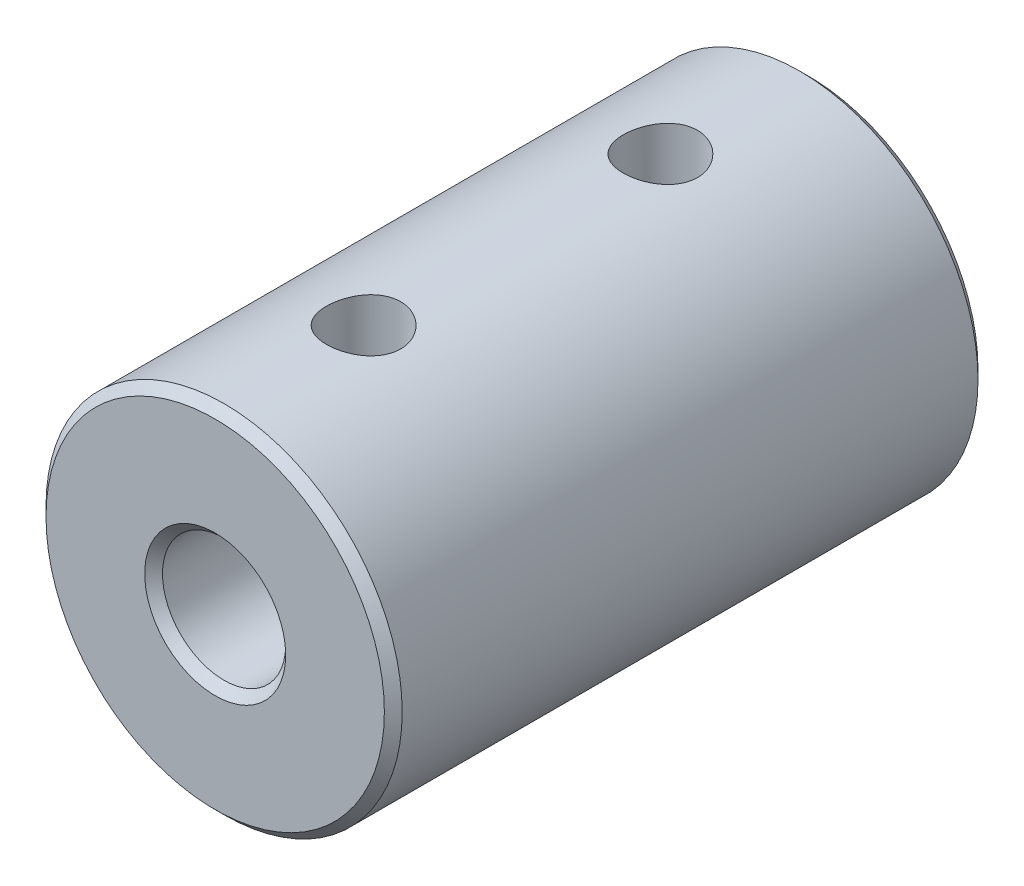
ISO-10303-21;
HEADER;
FILE_DESCRIPTION(('STEP AP214'),'2;1');
FILE_NAME('part.step','',(''),(''),'','','');
FILE_SCHEMA(('AUTOMOTIVE_DESIGN { 1 0 10303 214 1 1 1 1 }'));
ENDSEC;
DATA;
#1=APPLICATION_CONTEXT('core data for automotive mechanical design processes');
#2=APPLICATION_PROTOCOL_DEFINITION('international standard','automotive_design',2000,#1);
#3=PRODUCT_CONTEXT('',#1,'mechanical');
#4=PRODUCT('Part','Part','',(#3));
#5=PRODUCT_RELATED_PRODUCT_CATEGORY('part','',(#4));
#6=PRODUCT_DEFINITION_FORMATION('','',#4);
#7=PRODUCT_DEFINITION_CONTEXT('part definition',#1,'design');
#8=PRODUCT_DEFINITION('design','',#6,#7);
#9=PRODUCT_DEFINITION_SHAPE('','',#8);
#10=(LENGTH_UNIT() NAMED_UNIT(*) SI_UNIT(.MILLI.,.METRE.));
#11=(NAMED_UNIT(*) PLANE_ANGLE_UNIT() SI_UNIT($,.RADIAN.));
#12=(NAMED_UNIT(*) SI_UNIT($,.STERADIAN.) SOLID_ANGLE_UNIT());
#13=UNCERTAINTY_MEASURE_WITH_UNIT(LENGTH_MEASURE(1.E-05),#10,'distance_accuracy_value','');
#14=(GEOMETRIC_REPRESENTATION_CONTEXT(3) GLOBAL_UNCERTAINTY_ASSIGNED_CONTEXT((#13)) GLOBAL_UNIT_ASSIGNED_CONTEXT((#10,
#11,#12)) REPRESENTATION_CONTEXT('',''));
#15=CARTESIAN_POINT('',(0.,0.,0.));
#16=DIRECTION('',(0.,0.,1.));
#17=DIRECTION('',(1.,0.,0.));
#18=AXIS2_PLACEMENT_3D('',#15,#16,#17);
#19=CARTESIAN_POINT('',(0.,0.,10.));
#20=DIRECTION('',(0.,0.,1.));
#21=DIRECTION('',(1.,0.,0.));
#22=AXIS2_PLACEMENT_3D('',#19,#20,#21);
#23=PLANE('',#22);
#24=CARTESIAN_POINT('',(0.,0.,10.));
#25=DIRECTION('',(0.,0.,1.));
#26=DIRECTION('',(1.,0.,0.));
#27=AXIS2_PLACEMENT_3D('',#24,#25,#26);
#28=CIRCLE('',#27,5.7);
#29=CARTESIAN_POINT('',(-5.7,0.,10.));
#30=VERTEX_POINT('',#29);
#31=EDGE_CURVE('E10',#30,#30,#28,.T.);
#32=ORIENTED_EDGE('',*,*,#31,.T.);
#33=EDGE_LOOP('',(#32));
#34=FACE_BOUND('',#33,.T.);
#35=CARTESIAN_POINT('',(0.,0.,10.));
#36=DIRECTION('',(0.,0.,1.));
#37=DIRECTION('',(1.,0.,0.));
#38=AXIS2_PLACEMENT_3D('',#35,#36,#37);
#39=CIRCLE('',#38,2.375);
#40=CARTESIAN_POINT('',(2.375,0.,10.));
#41=VERTEX_POINT('',#40);
#42=EDGE_CURVE('E37',#41,#41,#39,.F.);
#43=ORIENTED_EDGE('',*,*,#42,.T.);
#44=EDGE_LOOP('',(#43));
#45=FACE_BOUND('',#44,.T.);
#46=ADVANCED_FACE('F30',(#34,#45),#23,.T.);
#47=CARTESIAN_POINT('',(0.,0.,-10.));
#48=DIRECTION('',(0.,0.,1.));
#49=DIRECTION('',(1.,0.,0.));
#50=AXIS2_PLACEMENT_3D('',#47,#48,#49);
#51=PLANE('',#50);
#52=CARTESIAN_POINT('',(0.,0.,-10.));
#53=DIRECTION('',(0.,0.,1.));
#54=DIRECTION('',(1.,0.,0.));
#55=AXIS2_PLACEMENT_3D('',#52,#53,#54);
#56=CIRCLE('',#55,2.375);
#57=CARTESIAN_POINT('',(2.375,0.,-10.));
#58=VERTEX_POINT('',#57);
#59=EDGE_CURVE('E56',#58,#58,#56,.T.);
#60=ORIENTED_EDGE('',*,*,#59,.T.);
#61=EDGE_LOOP('',(#60));
#62=FACE_BOUND('',#61,.T.);
#63=CARTESIAN_POINT('',(0.,0.,-10.));
#64=DIRECTION('',(0.,0.,1.));
#65=DIRECTION('',(1.,0.,0.));
#66=AXIS2_PLACEMENT_3D('',#63,#64,#65);
#67=CIRCLE('',#66,5.7);
#68=CARTESIAN_POINT('',(5.7,0.,-10.));
#69=VERTEX_POINT('',#68);
#70=EDGE_CURVE('E59',#69,#69,#67,.F.);
#71=ORIENTED_EDGE('',*,*,#70,.T.);
#72=EDGE_LOOP('',(#71));
#73=FACE_BOUND('',#72,.T.);
#74=ADVANCED_FACE('F105',(#62,#73),#51,.F.);
#75=CARTESIAN_POINT('',(0.,0.,10.));
#76=DIRECTION('',(0.,0.,-1.));
#77=DIRECTION('',(-1.,0.,0.));
#78=AXIS2_PLACEMENT_3D('',#75,#76,#77);
#79=CYLINDRICAL_SURFACE('',#78,6.);
#80=CARTESIAN_POINT('',(0.,0.,-9.7));
#81=DIRECTION('',(0.,0.,1.));
#82=DIRECTION('',(1.,0.,0.));
#83=AXIS2_PLACEMENT_3D('',#80,#81,#82);
#84=CIRCLE('',#83,6.);
#85=CARTESIAN_POINT('',(6.,0.,-9.7));
#86=VERTEX_POINT('',#85);
#87=EDGE_CURVE('E41',#86,#86,#84,.T.);
#88=ORIENTED_EDGE('',*,*,#87,.T.);
#89=EDGE_LOOP('',(#88));
#90=FACE_BOUND('',#89,.T.);
#91=CARTESIAN_POINT('',(0.,0.,9.7));
#92=DIRECTION('',(0.,0.,1.));
#93=DIRECTION('',(1.,0.,0.));
#94=AXIS2_PLACEMENT_3D('',#91,#92,#93);
#95=CIRCLE('',#94,6.);
#96=CARTESIAN_POINT('',(-6.,0.,9.7));
#97=VERTEX_POINT('',#96);
#98=EDGE_CURVE('E45',#97,#97,#95,.F.);
#99=ORIENTED_EDGE('',*,*,#98,.T.);
#100=EDGE_LOOP('',(#99));
#101=FACE_BOUND('',#100,.T.);
#102=CARTESIAN_POINT('',(0.,-6.,-3.75));
#103=CARTESIAN_POINT('',(0.0694090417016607,-5.99999871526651,-3.75000247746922));
#104=CARTESIAN_POINT('',(0.138848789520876,-5.99878328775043,-3.75580066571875));
#105=CARTESIAN_POINT('',(0.275761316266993,-5.9940520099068,-3.77881934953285));
#106=CARTESIAN_POINT('',(0.343232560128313,-5.99053441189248,-3.79604852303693));
#107=CARTESIAN_POINT('',(0.474209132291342,-5.98159109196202,-3.84137045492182));
#108=CARTESIAN_POINT('',(0.537718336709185,-5.97616727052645,-3.86945239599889));
#109=CARTESIAN_POINT('',(0.659120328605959,-5.96399927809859,-3.93564960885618));
#110=CARTESIAN_POINT('',(0.717013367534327,-5.95725516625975,-3.97376443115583));
#111=CARTESIAN_POINT('',(0.826390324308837,-5.9430770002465,-4.05953634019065));
#112=CARTESIAN_POINT('',(0.877780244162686,-5.93563505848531,-4.10731200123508));
#113=CARTESIAN_POINT('',(0.971877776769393,-5.92095657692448,-4.21079465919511));
#114=CARTESIAN_POINT('',(1.01458467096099,-5.91372005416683,-4.26650231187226));
#115=CARTESIAN_POINT('',(1.09051031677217,-5.90019442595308,-4.38495196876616));
#116=CARTESIAN_POINT('',(1.12363054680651,-5.89391545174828,-4.44775838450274));
#117=CARTESIAN_POINT('',(1.17881119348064,-5.8831284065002,-4.57819745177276));
#118=CARTESIAN_POINT('',(1.20087280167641,-5.87862014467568,-4.64582958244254));
#119=CARTESIAN_POINT('',(1.23300240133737,-5.87196500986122,-4.78298523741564));
#120=CARTESIAN_POINT('',(1.24323597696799,-5.86978556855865,-4.85246835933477));
#121=CARTESIAN_POINT('',(1.25193357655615,-5.86793690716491,-4.99219684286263));
#122=CARTESIAN_POINT('',(1.25039890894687,-5.86826740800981,-5.0624421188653));
#123=CARTESIAN_POINT('',(1.23573719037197,-5.87137174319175,-5.20048102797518));
#124=CARTESIAN_POINT('',(1.2228010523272,-5.87410533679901,-5.26829597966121));
#125=CARTESIAN_POINT('',(1.18600543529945,-5.88164437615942,-5.40077150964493));
#126=CARTESIAN_POINT('',(1.16214539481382,-5.88644992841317,-5.46543192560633));
#127=CARTESIAN_POINT('',(1.10400003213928,-5.89763191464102,-5.59030722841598));
#128=CARTESIAN_POINT('',(1.06964002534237,-5.90401953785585,-5.65048629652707));
#129=CARTESIAN_POINT('',(0.991522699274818,-5.91763890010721,-5.76429574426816));
#130=CARTESIAN_POINT('',(0.947764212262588,-5.92487074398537,-5.81792530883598));
#131=CARTESIAN_POINT('',(0.851074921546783,-5.93953730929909,-5.91821396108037));
#132=CARTESIAN_POINT('',(0.797981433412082,-5.94697323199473,-5.96471616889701));
#133=CARTESIAN_POINT('',(0.684667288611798,-5.96108088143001,-6.04818044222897));
#134=CARTESIAN_POINT('',(0.624446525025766,-5.96775259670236,-6.0851423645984));
#135=CARTESIAN_POINT('',(0.498405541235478,-5.97959870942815,-6.14851008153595));
#136=CARTESIAN_POINT('',(0.4325754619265,-5.98477039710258,-6.17489680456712));
#137=CARTESIAN_POINT('',(0.297284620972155,-5.99301338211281,-6.21619170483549));
#138=CARTESIAN_POINT('',(0.227824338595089,-5.99608495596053,-6.2311013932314));
#139=CARTESIAN_POINT('',(0.0885918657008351,-5.99974275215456,-6.24879425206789));
#140=CARTESIAN_POINT('',(0.0188480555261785,-6.00037293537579,-6.25179194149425));
#141=CARTESIAN_POINT('',(-0.120143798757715,-5.99919952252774,-6.2461550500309));
#142=CARTESIAN_POINT('',(-0.189391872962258,-5.99739607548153,-6.2375211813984));
#143=CARTESIAN_POINT('',(-0.324726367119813,-5.99158564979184,-6.20904434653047));
#144=CARTESIAN_POINT('',(-0.390837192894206,-5.98760052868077,-6.18931251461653));
#145=CARTESIAN_POINT('',(-0.518811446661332,-5.97787227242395,-6.13932213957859));
#146=CARTESIAN_POINT('',(-0.580674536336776,-5.97212899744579,-6.10906275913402));
#147=CARTESIAN_POINT('',(-0.699294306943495,-5.95941241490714,-6.03841962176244));
#148=CARTESIAN_POINT('',(-0.755973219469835,-5.9524239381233,-5.99790807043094));
#149=CARTESIAN_POINT('',(-0.861805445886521,-5.93802568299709,-5.90808043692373));
#150=CARTESIAN_POINT('',(-0.910957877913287,-5.93061585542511,-5.85876332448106));
#151=CARTESIAN_POINT('',(-1.0011786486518,-5.91606024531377,-5.7517444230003));
#152=CARTESIAN_POINT('',(-1.04209914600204,-5.90892089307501,-5.69391696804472));
#153=CARTESIAN_POINT('',(-1.11364719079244,-5.89585601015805,-5.57208371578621));
#154=CARTESIAN_POINT('',(-1.14427516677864,-5.88993042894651,-5.50807817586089));
#155=CARTESIAN_POINT('',(-1.19417246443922,-5.88001700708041,-5.37603880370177));
#156=CARTESIAN_POINT('',(-1.21350309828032,-5.87601872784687,-5.30802896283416));
#157=CARTESIAN_POINT('',(-1.24044038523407,-5.87039184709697,-5.16963344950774));
#158=CARTESIAN_POINT('',(-1.24804871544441,-5.86876290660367,-5.09924811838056));
#159=CARTESIAN_POINT('',(-1.25125926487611,-5.86807907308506,-4.95958659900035));
#160=CARTESIAN_POINT('',(-1.24709542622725,-5.86897402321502,-4.89031592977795));
#161=CARTESIAN_POINT('',(-1.22739905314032,-5.87312447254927,-4.75348599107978));
#162=CARTESIAN_POINT('',(-1.21186662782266,-5.87637994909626,-4.68592670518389));
#163=CARTESIAN_POINT('',(-1.16998217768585,-5.88486132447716,-4.55460222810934));
#164=CARTESIAN_POINT('',(-1.14366117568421,-5.8900815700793,-4.49082675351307));
#165=CARTESIAN_POINT('',(-1.08097457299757,-5.90190705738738,-4.36856122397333));
#166=CARTESIAN_POINT('',(-1.0446080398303,-5.9085124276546,-4.31007166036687));
#167=CARTESIAN_POINT('',(-0.962073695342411,-5.92251579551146,-4.19887837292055));
#168=CARTESIAN_POINT('',(-0.915737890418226,-5.92992613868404,-4.14630087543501));
#169=CARTESIAN_POINT('',(-0.814924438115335,-5.94461839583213,-4.04959050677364));
#170=CARTESIAN_POINT('',(-0.760444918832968,-5.9519002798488,-4.00545958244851));
#171=CARTESIAN_POINT('',(-0.644134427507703,-5.96561444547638,-3.92641142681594));
#172=CARTESIAN_POINT('',(-0.582225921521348,-5.97203596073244,-3.89160632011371));
#173=CARTESIAN_POINT('',(-0.453319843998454,-5.98319908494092,-3.83294977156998));
#174=CARTESIAN_POINT('',(-0.386326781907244,-5.98794216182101,-3.80908875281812));
#175=CARTESIAN_POINT('',(-0.266015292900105,-5.99432499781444,-3.77745972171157));
#176=CARTESIAN_POINT('',(-0.213367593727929,-5.99644035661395,-3.76718123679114));
#177=CARTESIAN_POINT('',(-0.107152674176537,-5.99927832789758,-3.75345054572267));
#178=CARTESIAN_POINT('',(-0.0535854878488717,-6.00000099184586,-3.74999808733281));
#179=CARTESIAN_POINT('',(0.,-6.,-3.75));
#180=B_SPLINE_CURVE_WITH_KNOTS('',3,(#102,#103,#104,#105,#106,#107,#108,#109,#110,#111,#112,
#113,#114,#115,#116,#117,#118,#119,#120,#121,#122,#123,#124,#125,#126,#127,#128,#129,#130,#131,
#132,#133,#134,#135,#136,#137,#138,#139,#140,#141,#142,#143,#144,#145,#146,#147,#148,#149,#150,
#151,#152,#153,#154,#155,#156,#157,#158,#159,#160,#161,#162,#163,#164,#165,#166,#167,#168,#169,
#170,#171,#172,#173,#174,#175,#176,#177,#178,#179),.UNSPECIFIED.,.T.,.F.,(4,2,2,2,2,2,2,2,2,2,2,
2,2,2,2,2,2,2,2,2,2,2,2,2,2,2,2,2,2,2,2,2,2,2,2,2,2,2,4),(0.,0.208031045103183,
0.416220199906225,0.624202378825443,0.83217524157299,1.04287526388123,1.25359271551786,
1.46640449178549,1.6791933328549,1.88896575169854,2.09871484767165,2.3050171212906,
2.5113300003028,2.71914592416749,2.92698768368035,3.13889526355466,3.35080602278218,
3.56309724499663,3.77536051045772,3.98378339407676,4.19219351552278,4.39855286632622,
4.60492863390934,4.81401583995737,5.02312752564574,5.23571263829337,5.4482888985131,
5.65970050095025,5.87108185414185,6.07829223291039,6.28550062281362,6.49211731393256,
6.6987531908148,6.9091902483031,7.1196757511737,7.33258864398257,7.54531486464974,
7.70592588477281,7.86653096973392),.UNSPECIFIED.);
#181=CARTESIAN_POINT('',(0.,-6.,-3.75));
#182=VERTEX_POINT('',#181);
#183=EDGE_CURVE('E96',#182,#182,#180,.T.);
#184=ORIENTED_EDGE('',*,*,#183,.T.);
#185=EDGE_LOOP('',(#184));
#186=FACE_BOUND('',#185,.T.);
#187=CARTESIAN_POINT('',(0.,6.,-3.75));
#188=CARTESIAN_POINT('',(-0.0694090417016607,5.99999871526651,-3.75000247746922));
#189=CARTESIAN_POINT('',(-0.138848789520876,5.99878328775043,-3.75580066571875));
#190=CARTESIAN_POINT('',(-0.275761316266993,5.9940520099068,-3.77881934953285));
#191=CARTESIAN_POINT('',(-0.343232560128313,5.99053441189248,-3.79604852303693));
#192=CARTESIAN_POINT('',(-0.474209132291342,5.98159109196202,-3.84137045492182));
#193=CARTESIAN_POINT('',(-0.537718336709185,5.97616727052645,-3.86945239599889));
#194=CARTESIAN_POINT('',(-0.659120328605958,5.96399927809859,-3.93564960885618));
#195=CARTESIAN_POINT('',(-0.717013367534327,5.95725516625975,-3.97376443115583));
#196=CARTESIAN_POINT('',(-0.826390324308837,5.9430770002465,-4.05953634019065));
#197=CARTESIAN_POINT('',(-0.877780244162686,5.93563505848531,-4.10731200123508));
#198=CARTESIAN_POINT('',(-0.971877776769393,5.92095657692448,-4.21079465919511));
#199=CARTESIAN_POINT('',(-1.01458467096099,5.91372005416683,-4.26650231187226));
#200=CARTESIAN_POINT('',(-1.09051031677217,5.90019442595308,-4.38495196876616));
#201=CARTESIAN_POINT('',(-1.12363054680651,5.89391545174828,-4.44775838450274));
#202=CARTESIAN_POINT('',(-1.17881119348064,5.8831284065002,-4.57819745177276));
#203=CARTESIAN_POINT('',(-1.20087280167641,5.87862014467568,-4.64582958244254));
#204=CARTESIAN_POINT('',(-1.23300240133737,5.87196500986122,-4.78298523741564));
#205=CARTESIAN_POINT('',(-1.24323597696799,5.86978556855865,-4.85246835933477));
#206=CARTESIAN_POINT('',(-1.25193357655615,5.86793690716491,-4.99219684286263));
#207=CARTESIAN_POINT('',(-1.25039890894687,5.86826740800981,-5.0624421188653));
#208=CARTESIAN_POINT('',(-1.23573719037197,5.87137174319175,-5.20048102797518));
#209=CARTESIAN_POINT('',(-1.2228010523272,5.87410533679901,-5.26829597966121));
#210=CARTESIAN_POINT('',(-1.18600543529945,5.88164437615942,-5.40077150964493));
#211=CARTESIAN_POINT('',(-1.16214539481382,5.88644992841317,-5.46543192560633));
#212=CARTESIAN_POINT('',(-1.10400003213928,5.89763191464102,-5.59030722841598));
#213=CARTESIAN_POINT('',(-1.06964002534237,5.90401953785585,-5.65048629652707));
#214=CARTESIAN_POINT('',(-0.991522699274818,5.91763890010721,-5.76429574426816));
#215=CARTESIAN_POINT('',(-0.947764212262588,5.92487074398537,-5.81792530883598));
#216=CARTESIAN_POINT('',(-0.851074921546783,5.93953730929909,-5.91821396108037));
#217=CARTESIAN_POINT('',(-0.797981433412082,5.94697323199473,-5.96471616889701));
#218=CARTESIAN_POINT('',(-0.684667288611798,5.96108088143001,-6.04818044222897));
#219=CARTESIAN_POINT('',(-0.624446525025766,5.96775259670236,-6.0851423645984));
#220=CARTESIAN_POINT('',(-0.498405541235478,5.97959870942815,-6.14851008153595));
#221=CARTESIAN_POINT('',(-0.4325754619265,5.98477039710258,-6.17489680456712));
#222=CARTESIAN_POINT('',(-0.297284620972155,5.99301338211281,-6.21619170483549));
#223=CARTESIAN_POINT('',(-0.227824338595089,5.99608495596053,-6.2311013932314));
#224=CARTESIAN_POINT('',(-0.0885918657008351,5.99974275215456,-6.24879425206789));
#225=CARTESIAN_POINT('',(-0.0188480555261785,6.00037293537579,-6.25179194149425));
#226=CARTESIAN_POINT('',(0.120143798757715,5.99919952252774,-6.2461550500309));
#227=CARTESIAN_POINT('',(0.189391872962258,5.99739607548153,-6.2375211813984));
#228=CARTESIAN_POINT('',(0.324726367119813,5.99158564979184,-6.20904434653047));
#229=CARTESIAN_POINT('',(0.390837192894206,5.98760052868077,-6.18931251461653));
#230=CARTESIAN_POINT('',(0.518811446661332,5.97787227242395,-6.13932213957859));
#231=CARTESIAN_POINT('',(0.580674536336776,5.97212899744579,-6.10906275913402));
#232=CARTESIAN_POINT('',(0.699294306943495,5.95941241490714,-6.03841962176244));
#233=CARTESIAN_POINT('',(0.755973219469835,5.9524239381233,-5.99790807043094));
#234=CARTESIAN_POINT('',(0.861805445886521,5.93802568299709,-5.90808043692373));
#235=CARTESIAN_POINT('',(0.910957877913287,5.93061585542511,-5.85876332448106));
#236=CARTESIAN_POINT('',(1.0011786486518,5.91606024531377,-5.7517444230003));
#237=CARTESIAN_POINT('',(1.04209914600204,5.90892089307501,-5.69391696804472));
#238=CARTESIAN_POINT('',(1.11364719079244,5.89585601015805,-5.57208371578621));
#239=CARTESIAN_POINT('',(1.14427516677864,5.88993042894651,-5.50807817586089));
#240=CARTESIAN_POINT('',(1.19417246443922,5.88001700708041,-5.37603880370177));
#241=CARTESIAN_POINT('',(1.21350309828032,5.87601872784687,-5.30802896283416));
#242=CARTESIAN_POINT('',(1.24044038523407,5.87039184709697,-5.16963344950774));
#243=CARTESIAN_POINT('',(1.24804871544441,5.86876290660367,-5.09924811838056));
#244=CARTESIAN_POINT('',(1.25125926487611,5.86807907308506,-4.95958659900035));
#245=CARTESIAN_POINT('',(1.24709542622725,5.86897402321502,-4.89031592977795));
#246=CARTESIAN_POINT('',(1.22739905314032,5.87312447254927,-4.75348599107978));
#247=CARTESIAN_POINT('',(1.21186662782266,5.87637994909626,-4.68592670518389));
#248=CARTESIAN_POINT('',(1.16998217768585,5.88486132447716,-4.55460222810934));
#249=CARTESIAN_POINT('',(1.14366117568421,5.8900815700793,-4.49082675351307));
#250=CARTESIAN_POINT('',(1.08097457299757,5.90190705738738,-4.36856122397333));
#251=CARTESIAN_POINT('',(1.0446080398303,5.9085124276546,-4.31007166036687));
#252=CARTESIAN_POINT('',(0.962073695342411,5.92251579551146,-4.19887837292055));
#253=CARTESIAN_POINT('',(0.915737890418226,5.92992613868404,-4.14630087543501));
#254=CARTESIAN_POINT('',(0.814924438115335,5.94461839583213,-4.04959050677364));
#255=CARTESIAN_POINT('',(0.760444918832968,5.9519002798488,-4.00545958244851));
#256=CARTESIAN_POINT('',(0.644134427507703,5.96561444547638,-3.92641142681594));
#257=CARTESIAN_POINT('',(0.582225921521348,5.97203596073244,-3.89160632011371));
#258=CARTESIAN_POINT('',(0.453319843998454,5.98319908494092,-3.83294977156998));
#259=CARTESIAN_POINT('',(0.386326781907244,5.98794216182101,-3.80908875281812));
#260=CARTESIAN_POINT('',(0.266015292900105,5.99432499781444,-3.77745972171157));
#261=CARTESIAN_POINT('',(0.213367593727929,5.99644035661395,-3.76718123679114));
#262=CARTESIAN_POINT('',(0.107152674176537,5.99927832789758,-3.75345054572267));
#263=CARTESIAN_POINT('',(0.0535854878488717,6.00000099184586,-3.74999808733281));
#264=CARTESIAN_POINT('',(0.,6.,-3.75));
#265=B_SPLINE_CURVE_WITH_KNOTS('',3,(#187,#188,#189,#190,#191,#192,#193,#194,#195,#196,#197,
#198,#199,#200,#201,#202,#203,#204,#205,#206,#207,#208,#209,#210,#211,#212,#213,#214,#215,#216,
#217,#218,#219,#220,#221,#222,#223,#224,#225,#226,#227,#228,#229,#230,#231,#232,#233,#234,#235,
#236,#237,#238,#239,#240,#241,#242,#243,#244,#245,#246,#247,#248,#249,#250,#251,#252,#253,#254,
#255,#256,#257,#258,#259,#260,#261,#262,#263,#264),.UNSPECIFIED.,.T.,.F.,(4,2,2,2,2,2,2,2,2,2,2,
2,2,2,2,2,2,2,2,2,2,2,2,2,2,2,2,2,2,2,2,2,2,2,2,2,2,2,4),(0.,0.208031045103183,
0.416220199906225,0.624202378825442,0.83217524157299,1.04287526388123,1.25359271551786,
1.46640449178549,1.6791933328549,1.88896575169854,2.09871484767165,2.3050171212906,
2.5113300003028,2.71914592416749,2.92698768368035,3.13889526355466,3.35080602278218,
3.56309724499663,3.77536051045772,3.98378339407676,4.19219351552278,4.39855286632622,
4.60492863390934,4.81401583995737,5.02312752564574,5.23571263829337,5.4482888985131,
5.65970050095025,5.87108185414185,6.07829223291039,6.28550062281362,6.49211731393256,
6.6987531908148,6.9091902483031,7.1196757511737,7.33258864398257,7.54531486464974,
7.70592588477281,7.86653096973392),.UNSPECIFIED.);
#266=CARTESIAN_POINT('',(0.,6.,-3.75));
#267=VERTEX_POINT('',#266);
#268=EDGE_CURVE('E70',#267,#267,#265,.T.);
#269=ORIENTED_EDGE('',*,*,#268,.T.);
#270=EDGE_LOOP('',(#269));
#271=FACE_BOUND('',#270,.T.);
#272=CARTESIAN_POINT('',(0.,-6.,6.25));
#273=CARTESIAN_POINT('',(0.0694090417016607,-5.99999871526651,6.24999752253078));
#274=CARTESIAN_POINT('',(0.138848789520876,-5.99878328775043,6.24419933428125));
#275=CARTESIAN_POINT('',(0.275761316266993,-5.9940520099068,6.22118065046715));
#276=CARTESIAN_POINT('',(0.343232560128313,-5.99053441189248,6.20395147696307));
#277=CARTESIAN_POINT('',(0.474209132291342,-5.98159109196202,6.15862954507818));
#278=CARTESIAN_POINT('',(0.537718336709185,-5.97616727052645,6.13054760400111));
#279=CARTESIAN_POINT('',(0.659120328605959,-5.96399927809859,6.06435039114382));
#280=CARTESIAN_POINT('',(0.717013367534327,-5.95725516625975,6.02623556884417));
#281=CARTESIAN_POINT('',(0.826390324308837,-5.9430770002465,5.94046365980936));
#282=CARTESIAN_POINT('',(0.877780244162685,-5.93563505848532,5.89268799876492));
#283=CARTESIAN_POINT('',(0.971877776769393,-5.92095657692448,5.78920534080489));
#284=CARTESIAN_POINT('',(1.01458467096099,-5.91372005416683,5.73349768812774));
#285=CARTESIAN_POINT('',(1.09051031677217,-5.90019442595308,5.61504803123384));
#286=CARTESIAN_POINT('',(1.12363054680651,-5.89391545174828,5.55224161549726));
#287=CARTESIAN_POINT('',(1.17881119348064,-5.8831284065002,5.42180254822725));
#288=CARTESIAN_POINT('',(1.20087280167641,-5.87862014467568,5.35417041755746));
#289=CARTESIAN_POINT('',(1.23300240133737,-5.87196500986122,5.21701476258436));
#290=CARTESIAN_POINT('',(1.24323597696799,-5.86978556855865,5.14753164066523));
#291=CARTESIAN_POINT('',(1.25193357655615,-5.86793690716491,5.00780315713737));
#292=CARTESIAN_POINT('',(1.25039890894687,-5.86826740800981,4.9375578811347));
#293=CARTESIAN_POINT('',(1.23573719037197,-5.87137174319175,4.79951897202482));
#294=CARTESIAN_POINT('',(1.2228010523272,-5.87410533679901,4.73170402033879));
#295=CARTESIAN_POINT('',(1.18600543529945,-5.88164437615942,4.59922849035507));
#296=CARTESIAN_POINT('',(1.16214539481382,-5.88644992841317,4.53456807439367));
#297=CARTESIAN_POINT('',(1.10400003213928,-5.89763191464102,4.40969277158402));
#298=CARTESIAN_POINT('',(1.06964002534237,-5.90401953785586,4.34951370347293));
#299=CARTESIAN_POINT('',(0.991522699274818,-5.91763890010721,4.23570425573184));
#300=CARTESIAN_POINT('',(0.947764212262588,-5.92487074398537,4.18207469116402));
#301=CARTESIAN_POINT('',(0.851074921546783,-5.93953730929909,4.08178603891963));
#302=CARTESIAN_POINT('',(0.797981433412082,-5.94697323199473,4.03528383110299));
#303=CARTESIAN_POINT('',(0.684667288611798,-5.96108088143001,3.95181955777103));
#304=CARTESIAN_POINT('',(0.624446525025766,-5.96775259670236,3.9148576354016));
#305=CARTESIAN_POINT('',(0.498405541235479,-5.97959870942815,3.85148991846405));
#306=CARTESIAN_POINT('',(0.4325754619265,-5.98477039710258,3.82510319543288));
#307=CARTESIAN_POINT('',(0.297284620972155,-5.99301338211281,3.78380829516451));
#308=CARTESIAN_POINT('',(0.22782433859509,-5.99608495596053,3.7688986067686));
#309=CARTESIAN_POINT('',(0.0885918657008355,-5.99974275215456,3.75120574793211));
#310=CARTESIAN_POINT('',(0.0188480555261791,-6.00037293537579,3.74820805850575));
#311=CARTESIAN_POINT('',(-0.120143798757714,-5.99919952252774,3.7538449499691));
#312=CARTESIAN_POINT('',(-0.189391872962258,-5.99739607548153,3.7624788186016));
#313=CARTESIAN_POINT('',(-0.324726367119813,-5.99158564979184,3.79095565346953));
#314=CARTESIAN_POINT('',(-0.390837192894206,-5.98760052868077,3.81068748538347));
#315=CARTESIAN_POINT('',(-0.518811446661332,-5.97787227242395,3.86067786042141));
#316=CARTESIAN_POINT('',(-0.580674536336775,-5.97212899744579,3.89093724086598));
#317=CARTESIAN_POINT('',(-0.699294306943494,-5.95941241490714,3.96158037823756));
#318=CARTESIAN_POINT('',(-0.755973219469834,-5.9524239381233,4.00209192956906));
#319=CARTESIAN_POINT('',(-0.86180544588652,-5.93802568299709,4.09191956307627));
#320=CARTESIAN_POINT('',(-0.910957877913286,-5.93061585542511,4.14123667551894));
#321=CARTESIAN_POINT('',(-1.0011786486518,-5.91606024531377,4.2482555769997));
#322=CARTESIAN_POINT('',(-1.04209914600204,-5.90892089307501,4.30608303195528));
#323=CARTESIAN_POINT('',(-1.11364719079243,-5.89585601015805,4.42791628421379));
#324=CARTESIAN_POINT('',(-1.14427516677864,-5.88993042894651,4.49192182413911));
#325=CARTESIAN_POINT('',(-1.19417246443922,-5.88001700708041,4.62396119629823));
#326=CARTESIAN_POINT('',(-1.21350309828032,-5.87601872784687,4.69197103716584));
#327=CARTESIAN_POINT('',(-1.24044038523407,-5.87039184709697,4.83036655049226));
#328=CARTESIAN_POINT('',(-1.24804871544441,-5.86876290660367,4.90075188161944));
#329=CARTESIAN_POINT('',(-1.25125926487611,-5.86807907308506,5.04041340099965));
#330=CARTESIAN_POINT('',(-1.24709542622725,-5.86897402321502,5.10968407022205));
#331=CARTESIAN_POINT('',(-1.22739905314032,-5.87312447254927,5.24651400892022));
#332=CARTESIAN_POINT('',(-1.21186662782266,-5.87637994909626,5.31407329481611));
#333=CARTESIAN_POINT('',(-1.16998217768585,-5.88486132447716,5.44539777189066));
#334=CARTESIAN_POINT('',(-1.14366117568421,-5.8900815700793,5.50917324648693));
#335=CARTESIAN_POINT('',(-1.08097457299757,-5.90190705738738,5.63143877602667));
#336=CARTESIAN_POINT('',(-1.0446080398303,-5.9085124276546,5.68992833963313));
#337=CARTESIAN_POINT('',(-0.962073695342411,-5.92251579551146,5.80112162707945));
#338=CARTESIAN_POINT('',(-0.915737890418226,-5.92992613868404,5.85369912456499));
#339=CARTESIAN_POINT('',(-0.814924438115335,-5.94461839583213,5.95040949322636));
#340=CARTESIAN_POINT('',(-0.760444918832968,-5.9519002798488,5.99454041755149));
#341=CARTESIAN_POINT('',(-0.644134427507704,-5.96561444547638,6.07358857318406));
#342=CARTESIAN_POINT('',(-0.582225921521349,-5.97203596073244,6.10839367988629));
#343=CARTESIAN_POINT('',(-0.453319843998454,-5.98319908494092,6.16705022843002));
#344=CARTESIAN_POINT('',(-0.386326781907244,-5.98794216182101,6.19091124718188));
#345=CARTESIAN_POINT('',(-0.266015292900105,-5.99432499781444,6.22254027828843));
#346=CARTESIAN_POINT('',(-0.213367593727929,-5.99644035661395,6.23281876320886));
#347=CARTESIAN_POINT('',(-0.107152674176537,-5.99927832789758,6.24654945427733));
#348=CARTESIAN_POINT('',(-0.0535854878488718,-6.00000099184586,6.25000191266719));
#349=CARTESIAN_POINT('',(0.,-6.,6.25));
#350=B_SPLINE_CURVE_WITH_KNOTS('',3,(#272,#273,#274,#275,#276,#277,#278,#279,#280,#281,#282,
#283,#284,#285,#286,#287,#288,#289,#290,#291,#292,#293,#294,#295,#296,#297,#298,#299,#300,#301,
#302,#303,#304,#305,#306,#307,#308,#309,#310,#311,#312,#313,#314,#315,#316,#317,#318,#319,#320,
#321,#322,#323,#324,#325,#326,#327,#328,#329,#330,#331,#332,#333,#334,#335,#336,#337,#338,#339,
#340,#341,#342,#343,#344,#345,#346,#347,#348,#349),.UNSPECIFIED.,.T.,.F.,(4,2,2,2,2,2,2,2,2,2,2,
2,2,2,2,2,2,2,2,2,2,2,2,2,2,2,2,2,2,2,2,2,2,2,2,2,2,2,4),(0.,0.208031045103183,
0.416220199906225,0.624202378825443,0.83217524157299,1.04287526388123,1.25359271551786,
1.46640449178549,1.6791933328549,1.88896575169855,2.09871484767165,2.3050171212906,
2.5113300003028,2.71914592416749,2.92698768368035,3.13889526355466,3.35080602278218,
3.56309724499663,3.77536051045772,3.98378339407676,4.19219351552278,4.39855286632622,
4.60492863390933,4.81401583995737,5.02312752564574,5.23571263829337,5.44828889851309,
5.65970050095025,5.87108185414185,6.07829223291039,6.28550062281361,6.49211731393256,
6.6987531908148,6.90919024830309,7.1196757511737,7.33258864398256,7.54531486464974,
7.7059258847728,7.86653096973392),.UNSPECIFIED.);
#351=CARTESIAN_POINT('',(0.,-6.,6.25));
#352=VERTEX_POINT('',#351);
#353=EDGE_CURVE('E62',#352,#352,#350,.T.);
#354=ORIENTED_EDGE('',*,*,#353,.T.);
#355=EDGE_LOOP('',(#354));
#356=FACE_BOUND('',#355,.T.);
#357=CARTESIAN_POINT('',(0.,6.,6.25));
#358=CARTESIAN_POINT('',(-0.0694090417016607,5.99999871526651,6.24999752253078));
#359=CARTESIAN_POINT('',(-0.138848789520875,5.99878328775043,6.24419933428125));
#360=CARTESIAN_POINT('',(-0.275761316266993,5.9940520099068,6.22118065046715));
#361=CARTESIAN_POINT('',(-0.343232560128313,5.99053441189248,6.20395147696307));
#362=CARTESIAN_POINT('',(-0.474209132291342,5.98159109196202,6.15862954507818));
#363=CARTESIAN_POINT('',(-0.537718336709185,5.97616727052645,6.13054760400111));
#364=CARTESIAN_POINT('',(-0.659120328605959,5.96399927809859,6.06435039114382));
#365=CARTESIAN_POINT('',(-0.717013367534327,5.95725516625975,6.02623556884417));
#366=CARTESIAN_POINT('',(-0.826390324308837,5.9430770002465,5.94046365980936));
#367=CARTESIAN_POINT('',(-0.877780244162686,5.93563505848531,5.89268799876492));
#368=CARTESIAN_POINT('',(-0.971877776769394,5.92095657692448,5.78920534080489));
#369=CARTESIAN_POINT('',(-1.01458467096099,5.91372005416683,5.73349768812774));
#370=CARTESIAN_POINT('',(-1.09051031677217,5.90019442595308,5.61504803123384));
#371=CARTESIAN_POINT('',(-1.12363054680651,5.89391545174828,5.55224161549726));
#372=CARTESIAN_POINT('',(-1.17881119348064,5.8831284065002,5.42180254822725));
#373=CARTESIAN_POINT('',(-1.20087280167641,5.87862014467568,5.35417041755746));
#374=CARTESIAN_POINT('',(-1.23300240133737,5.87196500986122,5.21701476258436));
#375=CARTESIAN_POINT('',(-1.24323597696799,5.86978556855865,5.14753164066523));
#376=CARTESIAN_POINT('',(-1.25193357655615,5.86793690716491,5.00780315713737));
#377=CARTESIAN_POINT('',(-1.25039890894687,5.86826740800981,4.9375578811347));
#378=CARTESIAN_POINT('',(-1.23573719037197,5.87137174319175,4.79951897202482));
#379=CARTESIAN_POINT('',(-1.2228010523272,5.87410533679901,4.73170402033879));
#380=CARTESIAN_POINT('',(-1.18600543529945,5.88164437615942,4.59922849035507));
#381=CARTESIAN_POINT('',(-1.16214539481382,5.88644992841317,4.53456807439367));
#382=CARTESIAN_POINT('',(-1.10400003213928,5.89763191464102,4.40969277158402));
#383=CARTESIAN_POINT('',(-1.06964002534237,5.90401953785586,4.34951370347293));
#384=CARTESIAN_POINT('',(-0.991522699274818,5.91763890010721,4.23570425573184));
#385=CARTESIAN_POINT('',(-0.947764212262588,5.92487074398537,4.18207469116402));
#386=CARTESIAN_POINT('',(-0.851074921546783,5.93953730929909,4.08178603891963));
#387=CARTESIAN_POINT('',(-0.797981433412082,5.94697323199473,4.03528383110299));
#388=CARTESIAN_POINT('',(-0.684667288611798,5.96108088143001,3.95181955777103));
#389=CARTESIAN_POINT('',(-0.624446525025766,5.96775259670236,3.9148576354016));
#390=CARTESIAN_POINT('',(-0.498405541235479,5.97959870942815,3.85148991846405));
#391=CARTESIAN_POINT('',(-0.4325754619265,5.98477039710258,3.82510319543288));
#392=CARTESIAN_POINT('',(-0.297284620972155,5.99301338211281,3.78380829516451));
#393=CARTESIAN_POINT('',(-0.22782433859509,5.99608495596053,3.7688986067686));
#394=CARTESIAN_POINT('',(-0.0885918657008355,5.99974275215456,3.75120574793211));
#395=CARTESIAN_POINT('',(-0.0188480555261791,6.00037293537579,3.74820805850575));
#396=CARTESIAN_POINT('',(0.120143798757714,5.99919952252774,3.7538449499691));
#397=CARTESIAN_POINT('',(0.189391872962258,5.99739607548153,3.7624788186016));
#398=CARTESIAN_POINT('',(0.324726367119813,5.99158564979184,3.79095565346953));
#399=CARTESIAN_POINT('',(0.390837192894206,5.98760052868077,3.81068748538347));
#400=CARTESIAN_POINT('',(0.518811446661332,5.97787227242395,3.86067786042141));
#401=CARTESIAN_POINT('',(0.580674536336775,5.97212899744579,3.89093724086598));
#402=CARTESIAN_POINT('',(0.699294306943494,5.95941241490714,3.96158037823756));
#403=CARTESIAN_POINT('',(0.755973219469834,5.9524239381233,4.00209192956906));
#404=CARTESIAN_POINT('',(0.86180544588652,5.93802568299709,4.09191956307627));
#405=CARTESIAN_POINT('',(0.910957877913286,5.93061585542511,4.14123667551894));
#406=CARTESIAN_POINT('',(1.0011786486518,5.91606024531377,4.2482555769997));
#407=CARTESIAN_POINT('',(1.04209914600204,5.90892089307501,4.30608303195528));
#408=CARTESIAN_POINT('',(1.11364719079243,5.89585601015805,4.42791628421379));
#409=CARTESIAN_POINT('',(1.14427516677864,5.88993042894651,4.49192182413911));
#410=CARTESIAN_POINT('',(1.19417246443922,5.88001700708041,4.62396119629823));
#411=CARTESIAN_POINT('',(1.21350309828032,5.87601872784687,4.69197103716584));
#412=CARTESIAN_POINT('',(1.24044038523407,5.87039184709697,4.83036655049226));
#413=CARTESIAN_POINT('',(1.24804871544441,5.86876290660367,4.90075188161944));
#414=CARTESIAN_POINT('',(1.25125926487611,5.86807907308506,5.04041340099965));
#415=CARTESIAN_POINT('',(1.24709542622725,5.86897402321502,5.10968407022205));
#416=CARTESIAN_POINT('',(1.22739905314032,5.87312447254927,5.24651400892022));
#417=CARTESIAN_POINT('',(1.21186662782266,5.87637994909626,5.31407329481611));
#418=CARTESIAN_POINT('',(1.16998217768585,5.88486132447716,5.44539777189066));
#419=CARTESIAN_POINT('',(1.14366117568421,5.8900815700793,5.50917324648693));
#420=CARTESIAN_POINT('',(1.08097457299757,5.90190705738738,5.63143877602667));
#421=CARTESIAN_POINT('',(1.0446080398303,5.9085124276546,5.68992833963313));
#422=CARTESIAN_POINT('',(0.962073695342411,5.92251579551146,5.80112162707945));
#423=CARTESIAN_POINT('',(0.915737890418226,5.92992613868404,5.85369912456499));
#424=CARTESIAN_POINT('',(0.814924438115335,5.94461839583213,5.95040949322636));
#425=CARTESIAN_POINT('',(0.760444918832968,5.9519002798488,5.99454041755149));
#426=CARTESIAN_POINT('',(0.644134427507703,5.96561444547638,6.07358857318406));
#427=CARTESIAN_POINT('',(0.582225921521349,5.97203596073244,6.10839367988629));
#428=CARTESIAN_POINT('',(0.453319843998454,5.98319908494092,6.16705022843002));
#429=CARTESIAN_POINT('',(0.386326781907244,5.98794216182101,6.19091124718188));
#430=CARTESIAN_POINT('',(0.266015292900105,5.99432499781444,6.22254027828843));
#431=CARTESIAN_POINT('',(0.213367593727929,5.99644035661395,6.23281876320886));
#432=CARTESIAN_POINT('',(0.107152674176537,5.99927832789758,6.24654945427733));
#433=CARTESIAN_POINT('',(0.0535854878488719,6.00000099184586,6.25000191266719));
#434=CARTESIAN_POINT('',(0.,6.,6.25));
#435=B_SPLINE_CURVE_WITH_KNOTS('',3,(#357,#358,#359,#360,#361,#362,#363,#364,#365,#366,#367,
#368,#369,#370,#371,#372,#373,#374,#375,#376,#377,#378,#379,#380,#381,#382,#383,#384,#385,#386,
#387,#388,#389,#390,#391,#392,#393,#394,#395,#396,#397,#398,#399,#400,#401,#402,#403,#404,#405,
#406,#407,#408,#409,#410,#411,#412,#413,#414,#415,#416,#417,#418,#419,#420,#421,#422,#423,#424,
#425,#426,#427,#428,#429,#430,#431,#432,#433,#434),.UNSPECIFIED.,.T.,.F.,(4,2,2,2,2,2,2,2,2,2,2,
2,2,2,2,2,2,2,2,2,2,2,2,2,2,2,2,2,2,2,2,2,2,2,2,2,2,2,4),(0.,0.208031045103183,
0.416220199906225,0.624202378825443,0.83217524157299,1.04287526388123,1.25359271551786,
1.46640449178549,1.6791933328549,1.88896575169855,2.09871484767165,2.3050171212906,
2.5113300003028,2.71914592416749,2.92698768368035,3.13889526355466,3.35080602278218,
3.56309724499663,3.77536051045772,3.98378339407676,4.19219351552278,4.39855286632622,
4.60492863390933,4.81401583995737,5.02312752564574,5.23571263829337,5.44828889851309,
5.65970050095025,5.87108185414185,6.07829223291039,6.28550062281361,6.49211731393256,
6.6987531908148,6.90919024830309,7.1196757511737,7.33258864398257,7.54531486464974,
7.7059258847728,7.86653096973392),.UNSPECIFIED.);
#436=CARTESIAN_POINT('',(0.,6.,6.25));
#437=VERTEX_POINT('',#436);
#438=EDGE_CURVE('E110',#437,#437,#435,.T.);
#439=ORIENTED_EDGE('',*,*,#438,.T.);
#440=EDGE_LOOP('',(#439));
#441=FACE_BOUND('',#440,.T.);
#442=ADVANCED_FACE('F100',(#90,#101,#186,#271,#356,#441),#79,.T.);
#443=CARTESIAN_POINT('',(0.,0.,10.));
#444=DIRECTION('',(0.,0.,-1.));
#445=DIRECTION('',(-1.,0.,0.));
#446=AXIS2_PLACEMENT_3D('',#443,#444,#445);
#447=CYLINDRICAL_SURFACE('',#446,2.075);
#448=CARTESIAN_POINT('',(0.,0.,-9.7));
#449=DIRECTION('',(0.,0.,1.));
#450=DIRECTION('',(1.,0.,0.));
#451=AXIS2_PLACEMENT_3D('',#448,#449,#450);
#452=CIRCLE('',#451,2.075);
#453=CARTESIAN_POINT('',(2.075,0.,-9.7));
#454=VERTEX_POINT('',#453);
#455=EDGE_CURVE('E50',#454,#454,#452,.F.);
#456=ORIENTED_EDGE('',*,*,#455,.T.);
#457=EDGE_LOOP('',(#456));
#458=FACE_BOUND('',#457,.T.);
#459=CARTESIAN_POINT('',(0.,0.,9.7));
#460=DIRECTION('',(0.,0.,1.));
#461=DIRECTION('',(1.,0.,0.));
#462=AXIS2_PLACEMENT_3D('',#459,#460,#461);
#463=CIRCLE('',#462,2.075);
#464=CARTESIAN_POINT('',(2.075,0.,9.7));
#465=VERTEX_POINT('',#464);
#466=EDGE_CURVE('E53',#465,#465,#463,.T.);
#467=ORIENTED_EDGE('',*,*,#466,.T.);
#468=EDGE_LOOP('',(#467));
#469=FACE_BOUND('',#468,.T.);
#470=CARTESIAN_POINT('',(0.,-2.075,-3.75));
#471=CARTESIAN_POINT('',(0.0639003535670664,-2.07499675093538,-3.75000354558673));
#472=CARTESIAN_POINT('',(0.127900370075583,-2.07201621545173,-3.75493410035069));
#473=CARTESIAN_POINT('',(0.253971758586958,-2.06037700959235,-3.77440328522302));
#474=CARTESIAN_POINT('',(0.316038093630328,-2.05170462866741,-3.78896511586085));
#475=CARTESIAN_POINT('',(0.43614930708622,-2.02955917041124,-3.82687586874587));
#476=CARTESIAN_POINT('',(0.494212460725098,-2.01610991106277,-3.85018122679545));
#477=CARTESIAN_POINT('',(0.605419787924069,-1.98555335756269,-3.90464418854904));
#478=CARTESIAN_POINT('',(0.658565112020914,-1.96844692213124,-3.93579994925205));
#479=CARTESIAN_POINT('',(0.763048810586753,-1.93046711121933,-4.00773802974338));
#480=CARTESIAN_POINT('',(0.813934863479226,-1.90940532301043,-4.04907594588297));
#481=CARTESIAN_POINT('',(0.908493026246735,-1.86627238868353,-4.13895215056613));
#482=CARTESIAN_POINT('',(0.952155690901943,-1.84419996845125,-4.18749971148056));
#483=CARTESIAN_POINT('',(1.03651378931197,-1.79828874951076,-4.29748885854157));
#484=CARTESIAN_POINT('',(1.07617227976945,-1.77456967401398,-4.35978268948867));
#485=CARTESIAN_POINT('',(1.14431226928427,-1.7314178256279,-4.49154484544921));
#486=CARTESIAN_POINT('',(1.17281199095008,-1.71197808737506,-4.56100123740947));
#487=CARTESIAN_POINT('',(1.21175925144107,-1.68454393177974,-4.68789473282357));
#488=CARTESIAN_POINT('',(1.22491141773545,-1.6749158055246,-4.74414690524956));
#489=CARTESIAN_POINT('',(1.24331991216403,-1.66129972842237,-4.85856966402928));
#490=CARTESIAN_POINT('',(1.24858618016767,-1.65730467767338,-4.91673774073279));
#491=CARTESIAN_POINT('',(1.25091758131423,-1.65554620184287,-5.03345301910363));
#492=CARTESIAN_POINT('',(1.24796614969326,-1.65779536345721,-5.09200074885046));
#493=CARTESIAN_POINT('',(1.23401615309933,-1.66820280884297,-5.20760541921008));
#494=CARTESIAN_POINT('',(1.22301149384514,-1.67636556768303,-5.26466119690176));
#495=CARTESIAN_POINT('',(1.19375104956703,-1.69732069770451,-5.37507258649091));
#496=CARTESIAN_POINT('',(1.1755973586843,-1.71004766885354,-5.42846837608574));
#497=CARTESIAN_POINT('',(1.13270947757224,-1.73875205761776,-5.53159388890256));
#498=CARTESIAN_POINT('',(1.10797288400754,-1.75473066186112,-5.58132226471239));
#499=CARTESIAN_POINT('',(1.04760481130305,-1.79153730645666,-5.68500277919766));
#500=CARTESIAN_POINT('',(1.01082201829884,-1.81272387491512,-5.73815758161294));
#501=CARTESIAN_POINT('',(0.929648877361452,-1.85566442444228,-5.83809516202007));
#502=CARTESIAN_POINT('',(0.885251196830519,-1.87741893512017,-5.88487171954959));
#503=CARTESIAN_POINT('',(0.782633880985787,-1.92267490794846,-5.97744995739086));
#504=CARTESIAN_POINT('',(0.723347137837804,-1.94598713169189,-6.02217435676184));
#505=CARTESIAN_POINT('',(0.596692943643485,-1.98847524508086,-6.10091165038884));
#506=CARTESIAN_POINT('',(0.529329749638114,-2.00765329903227,-6.13493015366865));
#507=CARTESIAN_POINT('',(0.392621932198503,-2.03864449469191,-6.18886586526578));
#508=CARTESIAN_POINT('',(0.323662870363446,-2.05084235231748,-6.20953017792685));
#509=CARTESIAN_POINT('',(0.182389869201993,-2.0681879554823,-6.23871626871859));
#510=CARTESIAN_POINT('',(0.110080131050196,-2.07334429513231,-6.24725284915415));
#511=CARTESIAN_POINT('',(-0.0250714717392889,-2.07579635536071,-6.2513206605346));
#512=CARTESIAN_POINT('',(-0.0878532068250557,-2.07407223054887,-6.24847344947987));
#513=CARTESIAN_POINT('',(-0.211885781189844,-2.06508910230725,-6.23349281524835));
#514=CARTESIAN_POINT('',(-0.273136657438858,-2.05783023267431,-6.22135961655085));
#515=CARTESIAN_POINT('',(-0.390883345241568,-2.03870238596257,-6.18884363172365));
#516=CARTESIAN_POINT('',(-0.447460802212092,-2.02695636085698,-6.16868030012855));
#517=CARTESIAN_POINT('',(-0.556413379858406,-1.9997962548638,-6.1209128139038));
#518=CARTESIAN_POINT('',(-0.608787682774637,-1.98438146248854,-6.09330721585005));
#519=CARTESIAN_POINT('',(-0.713716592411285,-1.94925706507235,-6.02825345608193));
#520=CARTESIAN_POINT('',(-0.765727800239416,-1.92926796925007,-5.99008191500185));
#521=CARTESIAN_POINT('',(-0.862998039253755,-1.88776650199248,-5.90656042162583));
#522=CARTESIAN_POINT('',(-0.908249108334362,-1.86625237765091,-5.86120213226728));
#523=CARTESIAN_POINT('',(-0.996859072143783,-1.82062975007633,-5.75763524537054));
#524=CARTESIAN_POINT('',(-1.03918213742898,-1.79655311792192,-5.6985208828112));
#525=CARTESIAN_POINT('',(-1.11333940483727,-1.75156624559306,-5.57295504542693));
#526=CARTESIAN_POINT('',(-1.14518433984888,-1.73065277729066,-5.50651117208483));
#527=CARTESIAN_POINT('',(-1.19144400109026,-1.69902821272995,-5.38254710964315));
#528=CARTESIAN_POINT('',(-1.2081368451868,-1.68708947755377,-5.32619377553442));
#529=CARTESIAN_POINT('',(-1.23349271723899,-1.66864368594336,-5.21087708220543));
#530=CARTESIAN_POINT('',(-1.24216703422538,-1.6621289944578,-5.15191751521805));
#531=CARTESIAN_POINT('',(-1.25100290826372,-1.65549118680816,-5.03275428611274));
#532=CARTESIAN_POINT('',(-1.25113100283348,-1.6553931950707,-4.97254665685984));
#533=CARTESIAN_POINT('',(-1.24277909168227,-1.66167063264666,-4.85306170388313));
#534=CARTESIAN_POINT('',(-1.23429452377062,-1.66804949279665,-4.79378489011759));
#535=CARTESIAN_POINT('',(-1.20988510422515,-1.68582696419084,-4.68086335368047));
#536=CARTESIAN_POINT('',(-1.19436244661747,-1.69695251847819,-4.62708560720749));
#537=CARTESIAN_POINT('',(-1.15668122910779,-1.72285648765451,-4.52285931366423));
#538=CARTESIAN_POINT('',(-1.13452016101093,-1.73763628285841,-4.47241203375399));
#539=CARTESIAN_POINT('',(-1.08029882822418,-1.77193588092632,-4.36799877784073));
#540=CARTESIAN_POINT('',(-1.04724260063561,-1.79183493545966,-4.31467595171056));
#541=CARTESIAN_POINT('',(-0.973804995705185,-1.83278457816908,-4.21380557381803));
#542=CARTESIAN_POINT('',(-0.933417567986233,-1.85383610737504,-4.16626284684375));
#543=CARTESIAN_POINT('',(-0.838561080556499,-1.89885036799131,-4.07016155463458));
#544=CARTESIAN_POINT('',(-0.782866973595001,-1.92271365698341,-4.02275387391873));
#545=CARTESIAN_POINT('',(-0.663137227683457,-1.96721845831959,-3.93786586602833));
#546=CARTESIAN_POINT('',(-0.599098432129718,-1.9878587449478,-3.90038931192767));
#547=CARTESIAN_POINT('',(-0.465975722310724,-2.02314123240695,-3.83783674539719));
#548=CARTESIAN_POINT('',(-0.397081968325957,-2.0379344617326,-3.81244446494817));
#549=CARTESIAN_POINT('',(-0.25496190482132,-2.06052123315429,-3.77408520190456));
#550=CARTESIAN_POINT('',(-0.181752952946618,-2.06834101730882,-3.76107162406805));
#551=CARTESIAN_POINT('',(-0.0899873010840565,-2.07312691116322,-3.75311193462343));
#552=CARTESIAN_POINT('',(-0.0720195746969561,-2.07382798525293,-3.75194641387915));
#553=CARTESIAN_POINT('',(-0.0360372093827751,-2.07476499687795,-3.7503899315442));
#554=CARTESIAN_POINT('',(-0.0180225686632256,-2.07500091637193,-3.74999899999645));
#555=CARTESIAN_POINT('',(0.,-2.075,-3.75));
#556=B_SPLINE_CURVE_WITH_KNOTS('',3,(#470,#471,#472,#473,#474,#475,#476,#477,#478,#479,#480,
#481,#482,#483,#484,#485,#486,#487,#488,#489,#490,#491,#492,#493,#494,#495,#496,#497,#498,#499,
#500,#501,#502,#503,#504,#505,#506,#507,#508,#509,#510,#511,#512,#513,#514,#515,#516,#517,#518,
#519,#520,#521,#522,#523,#524,#525,#526,#527,#528,#529,#530,#531,#532,#533,#534,#535,#536,#537,
#538,#539,#540,#541,#542,#543,#544,#545,#546,#547,#548,#549,#550,#551,#552,#553,#554,#555),
.UNSPECIFIED.,.T.,.F.,(4,2,2,2,2,2,2,2,2,2,2,2,2,2,2,2,2,2,2,2,2,2,2,2,2,2,2,2,2,2,2,2,2,2,2,2,
2,2,2,2,2,2,4),(0.,0.191623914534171,0.383711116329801,0.574853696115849,0.76595144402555,
0.971727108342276,1.17776975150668,1.40932655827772,1.64050363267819,1.81545910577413,
1.99019386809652,2.16528110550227,2.34050097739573,2.51330437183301,2.68617094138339,
2.88946635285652,3.09295863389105,3.32528461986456,3.55748868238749,3.77521161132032,
3.99266857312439,4.18033294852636,4.36799278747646,4.55084190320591,4.73372650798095,
4.93555705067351,5.13762346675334,5.36632769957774,5.59479693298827,5.77398195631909,
5.95291432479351,6.13254725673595,6.31227539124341,6.48282286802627,6.65343486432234,
6.85015894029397,7.04704611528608,7.27674197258,7.50652497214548,7.72990894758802,
7.95244870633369,8.0064925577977,8.06053850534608),.UNSPECIFIED.);
#557=CARTESIAN_POINT('',(0.,-2.075,-3.75));
#558=VERTEX_POINT('',#557);
#559=EDGE_CURVE('E63',#558,#558,#556,.T.);
#560=ORIENTED_EDGE('',*,*,#559,.F.);
#561=EDGE_LOOP('',(#560));
#562=FACE_BOUND('',#561,.T.);
#563=CARTESIAN_POINT('',(0.,2.075,-3.75));
#564=CARTESIAN_POINT('',(-0.0639003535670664,2.07499675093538,-3.75000354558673));
#565=CARTESIAN_POINT('',(-0.127900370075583,2.07201621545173,-3.75493410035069));
#566=CARTESIAN_POINT('',(-0.253971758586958,2.06037700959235,-3.77440328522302));
#567=CARTESIAN_POINT('',(-0.316038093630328,2.05170462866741,-3.78896511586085));
#568=CARTESIAN_POINT('',(-0.43614930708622,2.02955917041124,-3.82687586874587));
#569=CARTESIAN_POINT('',(-0.494212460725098,2.01610991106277,-3.85018122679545));
#570=CARTESIAN_POINT('',(-0.605419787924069,1.98555335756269,-3.90464418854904));
#571=CARTESIAN_POINT('',(-0.658565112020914,1.96844692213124,-3.93579994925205));
#572=CARTESIAN_POINT('',(-0.763048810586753,1.93046711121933,-4.00773802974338));
#573=CARTESIAN_POINT('',(-0.813934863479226,1.90940532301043,-4.04907594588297));
#574=CARTESIAN_POINT('',(-0.908493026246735,1.86627238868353,-4.13895215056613));
#575=CARTESIAN_POINT('',(-0.952155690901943,1.84419996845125,-4.18749971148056));
#576=CARTESIAN_POINT('',(-1.03651378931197,1.79828874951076,-4.29748885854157));
#577=CARTESIAN_POINT('',(-1.07617227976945,1.77456967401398,-4.35978268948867));
#578=CARTESIAN_POINT('',(-1.14431226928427,1.7314178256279,-4.49154484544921));
#579=CARTESIAN_POINT('',(-1.17281199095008,1.71197808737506,-4.56100123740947));
#580=CARTESIAN_POINT('',(-1.21175925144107,1.68454393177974,-4.68789473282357));
#581=CARTESIAN_POINT('',(-1.22491141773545,1.6749158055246,-4.74414690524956));
#582=CARTESIAN_POINT('',(-1.24331991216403,1.66129972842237,-4.85856966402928));
#583=CARTESIAN_POINT('',(-1.24858618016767,1.65730467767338,-4.91673774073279));
#584=CARTESIAN_POINT('',(-1.25091758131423,1.65554620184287,-5.03345301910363));
#585=CARTESIAN_POINT('',(-1.24796614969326,1.65779536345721,-5.09200074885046));
#586=CARTESIAN_POINT('',(-1.23401615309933,1.66820280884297,-5.20760541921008));
#587=CARTESIAN_POINT('',(-1.22301149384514,1.67636556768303,-5.26466119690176));
#588=CARTESIAN_POINT('',(-1.19375104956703,1.69732069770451,-5.37507258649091));
#589=CARTESIAN_POINT('',(-1.1755973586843,1.71004766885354,-5.42846837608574));
#590=CARTESIAN_POINT('',(-1.13270947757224,1.73875205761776,-5.53159388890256));
#591=CARTESIAN_POINT('',(-1.10797288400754,1.75473066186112,-5.58132226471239));
#592=CARTESIAN_POINT('',(-1.04760481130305,1.79153730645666,-5.68500277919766));
#593=CARTESIAN_POINT('',(-1.01082201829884,1.81272387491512,-5.73815758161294));
#594=CARTESIAN_POINT('',(-0.929648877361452,1.85566442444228,-5.83809516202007));
#595=CARTESIAN_POINT('',(-0.885251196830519,1.87741893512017,-5.88487171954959));
#596=CARTESIAN_POINT('',(-0.782633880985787,1.92267490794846,-5.97744995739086));
#597=CARTESIAN_POINT('',(-0.723347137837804,1.94598713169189,-6.02217435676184));
#598=CARTESIAN_POINT('',(-0.596692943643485,1.98847524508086,-6.10091165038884));
#599=CARTESIAN_POINT('',(-0.529329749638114,2.00765329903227,-6.13493015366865));
#600=CARTESIAN_POINT('',(-0.392621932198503,2.03864449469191,-6.18886586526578));
#601=CARTESIAN_POINT('',(-0.323662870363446,2.05084235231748,-6.20953017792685));
#602=CARTESIAN_POINT('',(-0.182389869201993,2.0681879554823,-6.23871626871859));
#603=CARTESIAN_POINT('',(-0.110080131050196,2.07334429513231,-6.24725284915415));
#604=CARTESIAN_POINT('',(0.0250714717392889,2.07579635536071,-6.2513206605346));
#605=CARTESIAN_POINT('',(0.0878532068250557,2.07407223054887,-6.24847344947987));
#606=CARTESIAN_POINT('',(0.211885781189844,2.06508910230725,-6.23349281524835));
#607=CARTESIAN_POINT('',(0.273136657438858,2.05783023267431,-6.22135961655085));
#608=CARTESIAN_POINT('',(0.390883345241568,2.03870238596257,-6.18884363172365));
#609=CARTESIAN_POINT('',(0.447460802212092,2.02695636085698,-6.16868030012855));
#610=CARTESIAN_POINT('',(0.556413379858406,1.9997962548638,-6.1209128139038));
#611=CARTESIAN_POINT('',(0.608787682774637,1.98438146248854,-6.09330721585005));
#612=CARTESIAN_POINT('',(0.713716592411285,1.94925706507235,-6.02825345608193));
#613=CARTESIAN_POINT('',(0.765727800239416,1.92926796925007,-5.99008191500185));
#614=CARTESIAN_POINT('',(0.862998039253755,1.88776650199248,-5.90656042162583));
#615=CARTESIAN_POINT('',(0.908249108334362,1.86625237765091,-5.86120213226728));
#616=CARTESIAN_POINT('',(0.996859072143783,1.82062975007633,-5.75763524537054));
#617=CARTESIAN_POINT('',(1.03918213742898,1.79655311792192,-5.6985208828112));
#618=CARTESIAN_POINT('',(1.11333940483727,1.75156624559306,-5.57295504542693));
#619=CARTESIAN_POINT('',(1.14518433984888,1.73065277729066,-5.50651117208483));
#620=CARTESIAN_POINT('',(1.19144400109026,1.69902821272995,-5.38254710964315));
#621=CARTESIAN_POINT('',(1.2081368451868,1.68708947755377,-5.32619377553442));
#622=CARTESIAN_POINT('',(1.23349271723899,1.66864368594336,-5.21087708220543));
#623=CARTESIAN_POINT('',(1.24216703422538,1.6621289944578,-5.15191751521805));
#624=CARTESIAN_POINT('',(1.25100290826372,1.65549118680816,-5.03275428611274));
#625=CARTESIAN_POINT('',(1.25113100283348,1.6553931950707,-4.97254665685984));
#626=CARTESIAN_POINT('',(1.24277909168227,1.66167063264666,-4.85306170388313));
#627=CARTESIAN_POINT('',(1.23429452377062,1.66804949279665,-4.79378489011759));
#628=CARTESIAN_POINT('',(1.20988510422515,1.68582696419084,-4.68086335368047));
#629=CARTESIAN_POINT('',(1.19436244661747,1.69695251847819,-4.62708560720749));
#630=CARTESIAN_POINT('',(1.15668122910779,1.72285648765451,-4.52285931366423));
#631=CARTESIAN_POINT('',(1.13452016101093,1.73763628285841,-4.47241203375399));
#632=CARTESIAN_POINT('',(1.08029882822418,1.77193588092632,-4.36799877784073));
#633=CARTESIAN_POINT('',(1.04724260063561,1.79183493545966,-4.31467595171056));
#634=CARTESIAN_POINT('',(0.973804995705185,1.83278457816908,-4.21380557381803));
#635=CARTESIAN_POINT('',(0.933417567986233,1.85383610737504,-4.16626284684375));
#636=CARTESIAN_POINT('',(0.838561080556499,1.89885036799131,-4.07016155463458));
#637=CARTESIAN_POINT('',(0.782866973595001,1.92271365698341,-4.02275387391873));
#638=CARTESIAN_POINT('',(0.663137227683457,1.96721845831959,-3.93786586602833));
#639=CARTESIAN_POINT('',(0.599098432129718,1.9878587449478,-3.90038931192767));
#640=CARTESIAN_POINT('',(0.465975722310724,2.02314123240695,-3.83783674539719));
#641=CARTESIAN_POINT('',(0.397081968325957,2.0379344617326,-3.81244446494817));
#642=CARTESIAN_POINT('',(0.25496190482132,2.06052123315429,-3.77408520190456));
#643=CARTESIAN_POINT('',(0.181752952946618,2.06834101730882,-3.76107162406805));
#644=CARTESIAN_POINT('',(0.0899873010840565,2.07312691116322,-3.75311193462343));
#645=CARTESIAN_POINT('',(0.0720195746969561,2.07382798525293,-3.75194641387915));
#646=CARTESIAN_POINT('',(0.0360372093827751,2.07476499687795,-3.7503899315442));
#647=CARTESIAN_POINT('',(0.0180225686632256,2.07500091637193,-3.74999899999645));
#648=CARTESIAN_POINT('',(0.,2.075,-3.75));
#649=B_SPLINE_CURVE_WITH_KNOTS('',3,(#563,#564,#565,#566,#567,#568,#569,#570,#571,#572,#573,
#574,#575,#576,#577,#578,#579,#580,#581,#582,#583,#584,#585,#586,#587,#588,#589,#590,#591,#592,
#593,#594,#595,#596,#597,#598,#599,#600,#601,#602,#603,#604,#605,#606,#607,#608,#609,#610,#611,
#612,#613,#614,#615,#616,#617,#618,#619,#620,#621,#622,#623,#624,#625,#626,#627,#628,#629,#630,
#631,#632,#633,#634,#635,#636,#637,#638,#639,#640,#641,#642,#643,#644,#645,#646,#647,#648),
.UNSPECIFIED.,.T.,.F.,(4,2,2,2,2,2,2,2,2,2,2,2,2,2,2,2,2,2,2,2,2,2,2,2,2,2,2,2,2,2,2,2,2,2,2,2,
2,2,2,2,2,2,4),(0.,0.191623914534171,0.383711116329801,0.574853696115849,0.76595144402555,
0.971727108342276,1.17776975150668,1.40932655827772,1.64050363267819,1.81545910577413,
1.99019386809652,2.16528110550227,2.34050097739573,2.51330437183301,2.68617094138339,
2.88946635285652,3.09295863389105,3.32528461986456,3.55748868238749,3.77521161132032,
3.99266857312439,4.18033294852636,4.36799278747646,4.55084190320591,4.73372650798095,
4.93555705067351,5.13762346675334,5.36632769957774,5.59479693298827,5.77398195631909,
5.95291432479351,6.13254725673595,6.31227539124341,6.48282286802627,6.65343486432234,
6.85015894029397,7.04704611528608,7.27674197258,7.50652497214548,7.72990894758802,
7.95244870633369,8.0064925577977,8.06053850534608),.UNSPECIFIED.);
#650=CARTESIAN_POINT('',(0.,2.075,-3.75));
#651=VERTEX_POINT('',#650);
#652=EDGE_CURVE('E71',#651,#651,#649,.T.);
#653=ORIENTED_EDGE('',*,*,#652,.F.);
#654=EDGE_LOOP('',(#653));
#655=FACE_BOUND('',#654,.T.);
#656=CARTESIAN_POINT('',(0.,-2.075,6.25));
#657=CARTESIAN_POINT('',(0.0639003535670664,-2.07499675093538,6.24999645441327));
#658=CARTESIAN_POINT('',(0.127900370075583,-2.07201621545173,6.24506589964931));
#659=CARTESIAN_POINT('',(0.253971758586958,-2.06037700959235,6.22559671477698));
#660=CARTESIAN_POINT('',(0.316038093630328,-2.05170462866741,6.21103488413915));
#661=CARTESIAN_POINT('',(0.43614930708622,-2.02955917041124,6.17312413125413));
#662=CARTESIAN_POINT('',(0.494212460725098,-2.01610991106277,6.14981877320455));
#663=CARTESIAN_POINT('',(0.60541978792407,-1.98555335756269,6.09535581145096));
#664=CARTESIAN_POINT('',(0.658565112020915,-1.96844692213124,6.06420005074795));
#665=CARTESIAN_POINT('',(0.763048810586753,-1.93046711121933,5.99226197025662));
#666=CARTESIAN_POINT('',(0.813934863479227,-1.90940532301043,5.95092405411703));
#667=CARTESIAN_POINT('',(0.908493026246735,-1.86627238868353,5.86104784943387));
#668=CARTESIAN_POINT('',(0.952155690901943,-1.84419996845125,5.81250028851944));
#669=CARTESIAN_POINT('',(1.03651378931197,-1.79828874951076,5.70251114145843));
#670=CARTESIAN_POINT('',(1.07617227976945,-1.77456967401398,5.64021731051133));
#671=CARTESIAN_POINT('',(1.14431226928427,-1.7314178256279,5.50845515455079));
#672=CARTESIAN_POINT('',(1.17281199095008,-1.71197808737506,5.43899876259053));
#673=CARTESIAN_POINT('',(1.21175925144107,-1.68454393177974,5.31210526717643));
#674=CARTESIAN_POINT('',(1.22491141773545,-1.6749158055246,5.25585309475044));
#675=CARTESIAN_POINT('',(1.24331991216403,-1.66129972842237,5.14143033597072));
#676=CARTESIAN_POINT('',(1.24858618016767,-1.65730467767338,5.08326225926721));
#677=CARTESIAN_POINT('',(1.25091758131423,-1.65554620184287,4.96654698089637));
#678=CARTESIAN_POINT('',(1.24796614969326,-1.65779536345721,4.90799925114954));
#679=CARTESIAN_POINT('',(1.23401615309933,-1.66820280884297,4.79239458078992));
#680=CARTESIAN_POINT('',(1.22301149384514,-1.67636556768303,4.73533880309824));
#681=CARTESIAN_POINT('',(1.19375104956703,-1.69732069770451,4.62492741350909));
#682=CARTESIAN_POINT('',(1.1755973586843,-1.71004766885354,4.57153162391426));
#683=CARTESIAN_POINT('',(1.13270947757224,-1.73875205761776,4.46840611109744));
#684=CARTESIAN_POINT('',(1.10797288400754,-1.75473066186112,4.41867773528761));
#685=CARTESIAN_POINT('',(1.04760481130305,-1.79153730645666,4.31499722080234));
#686=CARTESIAN_POINT('',(1.01082201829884,-1.81272387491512,4.26184241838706));
#687=CARTESIAN_POINT('',(0.929648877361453,-1.85566442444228,4.16190483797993));
#688=CARTESIAN_POINT('',(0.88525119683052,-1.87741893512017,4.11512828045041));
#689=CARTESIAN_POINT('',(0.782633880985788,-1.92267490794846,4.02255004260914));
#690=CARTESIAN_POINT('',(0.723347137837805,-1.94598713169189,3.97782564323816));
#691=CARTESIAN_POINT('',(0.596692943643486,-1.98847524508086,3.89908834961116));
#692=CARTESIAN_POINT('',(0.529329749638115,-2.00765329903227,3.86506984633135));
#693=CARTESIAN_POINT('',(0.392621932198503,-2.03864449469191,3.81113413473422));
#694=CARTESIAN_POINT('',(0.323662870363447,-2.05084235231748,3.79046982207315));
#695=CARTESIAN_POINT('',(0.182389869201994,-2.0681879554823,3.76128373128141));
#696=CARTESIAN_POINT('',(0.110080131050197,-2.07334429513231,3.75274715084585));
#697=CARTESIAN_POINT('',(-0.0250714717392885,-2.07579635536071,3.7486793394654));
#698=CARTESIAN_POINT('',(-0.0878532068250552,-2.07407223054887,3.75152655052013));
#699=CARTESIAN_POINT('',(-0.211885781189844,-2.06508910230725,3.76650718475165));
#700=CARTESIAN_POINT('',(-0.273136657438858,-2.05783023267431,3.77864038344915));
#701=CARTESIAN_POINT('',(-0.390883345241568,-2.03870238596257,3.81115636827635));
#702=CARTESIAN_POINT('',(-0.447460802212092,-2.02695636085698,3.83131969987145));
#703=CARTESIAN_POINT('',(-0.556413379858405,-1.9997962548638,3.8790871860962));
#704=CARTESIAN_POINT('',(-0.608787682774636,-1.98438146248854,3.90669278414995));
#705=CARTESIAN_POINT('',(-0.713716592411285,-1.94925706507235,3.97174654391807));
#706=CARTESIAN_POINT('',(-0.765727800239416,-1.92926796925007,4.00991808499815));
#707=CARTESIAN_POINT('',(-0.862998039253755,-1.88776650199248,4.09343957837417));
#708=CARTESIAN_POINT('',(-0.908249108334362,-1.86625237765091,4.13879786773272));
#709=CARTESIAN_POINT('',(-0.996859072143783,-1.82062975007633,4.24236475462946));
#710=CARTESIAN_POINT('',(-1.03918213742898,-1.79655311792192,4.3014791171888));
#711=CARTESIAN_POINT('',(-1.11333940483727,-1.75156624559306,4.42704495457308));
#712=CARTESIAN_POINT('',(-1.14518433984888,-1.73065277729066,4.49348882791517));
#713=CARTESIAN_POINT('',(-1.19144400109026,-1.69902821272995,4.61745289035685));
#714=CARTESIAN_POINT('',(-1.2081368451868,-1.68708947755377,4.67380622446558));
#715=CARTESIAN_POINT('',(-1.23349271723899,-1.66864368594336,4.78912291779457));
#716=CARTESIAN_POINT('',(-1.24216703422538,-1.6621289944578,4.84808248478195));
#717=CARTESIAN_POINT('',(-1.25100290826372,-1.65549118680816,4.96724571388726));
#718=CARTESIAN_POINT('',(-1.25113100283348,-1.6553931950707,5.02745334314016));
#719=CARTESIAN_POINT('',(-1.24277909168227,-1.66167063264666,5.14693829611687));
#720=CARTESIAN_POINT('',(-1.23429452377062,-1.66804949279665,5.20621510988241));
#721=CARTESIAN_POINT('',(-1.20988510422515,-1.68582696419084,5.31913664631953));
#722=CARTESIAN_POINT('',(-1.19436244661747,-1.69695251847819,5.37291439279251));
#723=CARTESIAN_POINT('',(-1.15668122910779,-1.72285648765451,5.47714068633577));
#724=CARTESIAN_POINT('',(-1.13452016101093,-1.73763628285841,5.52758796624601));
#725=CARTESIAN_POINT('',(-1.08029882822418,-1.77193588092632,5.63200122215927));
#726=CARTESIAN_POINT('',(-1.04724260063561,-1.79183493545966,5.68532404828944));
#727=CARTESIAN_POINT('',(-0.973804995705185,-1.83278457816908,5.78619442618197));
#728=CARTESIAN_POINT('',(-0.933417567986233,-1.85383610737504,5.83373715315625));
#729=CARTESIAN_POINT('',(-0.838561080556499,-1.89885036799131,5.92983844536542));
#730=CARTESIAN_POINT('',(-0.782866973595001,-1.92271365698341,5.97724612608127));
#731=CARTESIAN_POINT('',(-0.663137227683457,-1.9672184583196,6.06213413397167));
#732=CARTESIAN_POINT('',(-0.599098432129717,-1.9878587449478,6.09961068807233));
#733=CARTESIAN_POINT('',(-0.465975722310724,-2.02314123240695,6.16216325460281));
#734=CARTESIAN_POINT('',(-0.397081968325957,-2.0379344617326,6.18755553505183));
#735=CARTESIAN_POINT('',(-0.254961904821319,-2.06052123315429,6.22591479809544));
#736=CARTESIAN_POINT('',(-0.181752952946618,-2.06834101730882,6.23892837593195));
#737=CARTESIAN_POINT('',(-0.0899873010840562,-2.07312691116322,6.24688806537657));
#738=CARTESIAN_POINT('',(-0.0720195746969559,-2.07382798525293,6.24805358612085));
#739=CARTESIAN_POINT('',(-0.0360372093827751,-2.07476499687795,6.2496100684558));
#740=CARTESIAN_POINT('',(-0.0180225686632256,-2.07500091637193,6.25000100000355));
#741=CARTESIAN_POINT('',(0.,-2.075,6.25));
#742=B_SPLINE_CURVE_WITH_KNOTS('',3,(#656,#657,#658,#659,#660,#661,#662,#663,#664,#665,#666,
#667,#668,#669,#670,#671,#672,#673,#674,#675,#676,#677,#678,#679,#680,#681,#682,#683,#684,#685,
#686,#687,#688,#689,#690,#691,#692,#693,#694,#695,#696,#697,#698,#699,#700,#701,#702,#703,#704,
#705,#706,#707,#708,#709,#710,#711,#712,#713,#714,#715,#716,#717,#718,#719,#720,#721,#722,#723,
#724,#725,#726,#727,#728,#729,#730,#731,#732,#733,#734,#735,#736,#737,#738,#739,#740,#741),
.UNSPECIFIED.,.T.,.F.,(4,2,2,2,2,2,2,2,2,2,2,2,2,2,2,2,2,2,2,2,2,2,2,2,2,2,2,2,2,2,2,2,2,2,2,2,
2,2,2,2,2,2,4),(0.,0.191623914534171,0.383711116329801,0.57485369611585,0.765951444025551,
0.971727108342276,1.17776975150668,1.40932655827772,1.64050363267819,1.81545910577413,
1.99019386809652,2.16528110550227,2.34050097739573,2.51330437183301,2.68617094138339,
2.88946635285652,3.09295863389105,3.32528461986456,3.55748868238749,3.77521161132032,
3.99266857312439,4.18033294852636,4.36799278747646,4.55084190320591,4.73372650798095,
4.93555705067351,5.13762346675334,5.36632769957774,5.59479693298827,5.77398195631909,
5.95291432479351,6.13254725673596,6.31227539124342,6.48282286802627,6.65343486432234,
6.85015894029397,7.04704611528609,7.27674197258,7.50652497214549,7.72990894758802,
7.95244870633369,8.00649255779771,8.06053850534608),.UNSPECIFIED.);
#743=CARTESIAN_POINT('',(0.,-2.075,6.25));
#744=VERTEX_POINT('',#743);
#745=EDGE_CURVE('E123',#744,#744,#742,.T.);
#746=ORIENTED_EDGE('',*,*,#745,.F.);
#747=EDGE_LOOP('',(#746));
#748=FACE_BOUND('',#747,.T.);
#749=CARTESIAN_POINT('',(0.,2.075,6.25));
#750=CARTESIAN_POINT('',(-0.0639003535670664,2.07499675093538,6.24999645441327));
#751=CARTESIAN_POINT('',(-0.127900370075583,2.07201621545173,6.24506589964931));
#752=CARTESIAN_POINT('',(-0.253971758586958,2.06037700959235,6.22559671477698));
#753=CARTESIAN_POINT('',(-0.316038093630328,2.05170462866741,6.21103488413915));
#754=CARTESIAN_POINT('',(-0.43614930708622,2.02955917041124,6.17312413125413));
#755=CARTESIAN_POINT('',(-0.494212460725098,2.01610991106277,6.14981877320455));
#756=CARTESIAN_POINT('',(-0.60541978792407,1.98555335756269,6.09535581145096));
#757=CARTESIAN_POINT('',(-0.658565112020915,1.96844692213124,6.06420005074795));
#758=CARTESIAN_POINT('',(-0.763048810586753,1.93046711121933,5.99226197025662));
#759=CARTESIAN_POINT('',(-0.813934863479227,1.90940532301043,5.95092405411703));
#760=CARTESIAN_POINT('',(-0.908493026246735,1.86627238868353,5.86104784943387));
#761=CARTESIAN_POINT('',(-0.952155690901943,1.84419996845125,5.81250028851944));
#762=CARTESIAN_POINT('',(-1.03651378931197,1.79828874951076,5.70251114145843));
#763=CARTESIAN_POINT('',(-1.07617227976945,1.77456967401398,5.64021731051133));
#764=CARTESIAN_POINT('',(-1.14431226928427,1.7314178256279,5.50845515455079));
#765=CARTESIAN_POINT('',(-1.17281199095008,1.71197808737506,5.43899876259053));
#766=CARTESIAN_POINT('',(-1.21175925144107,1.68454393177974,5.31210526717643));
#767=CARTESIAN_POINT('',(-1.22491141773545,1.6749158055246,5.25585309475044));
#768=CARTESIAN_POINT('',(-1.24331991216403,1.66129972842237,5.14143033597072));
#769=CARTESIAN_POINT('',(-1.24858618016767,1.65730467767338,5.08326225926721));
#770=CARTESIAN_POINT('',(-1.25091758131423,1.65554620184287,4.96654698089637));
#771=CARTESIAN_POINT('',(-1.24796614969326,1.65779536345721,4.90799925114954));
#772=CARTESIAN_POINT('',(-1.23401615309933,1.66820280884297,4.79239458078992));
#773=CARTESIAN_POINT('',(-1.22301149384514,1.67636556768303,4.73533880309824));
#774=CARTESIAN_POINT('',(-1.19375104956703,1.69732069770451,4.62492741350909));
#775=CARTESIAN_POINT('',(-1.1755973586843,1.71004766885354,4.57153162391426));
#776=CARTESIAN_POINT('',(-1.13270947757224,1.73875205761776,4.46840611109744));
#777=CARTESIAN_POINT('',(-1.10797288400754,1.75473066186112,4.41867773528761));
#778=CARTESIAN_POINT('',(-1.04760481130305,1.79153730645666,4.31499722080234));
#779=CARTESIAN_POINT('',(-1.01082201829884,1.81272387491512,4.26184241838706));
#780=CARTESIAN_POINT('',(-0.929648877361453,1.85566442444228,4.16190483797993));
#781=CARTESIAN_POINT('',(-0.88525119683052,1.87741893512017,4.11512828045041));
#782=CARTESIAN_POINT('',(-0.782633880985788,1.92267490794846,4.02255004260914));
#783=CARTESIAN_POINT('',(-0.723347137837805,1.94598713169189,3.97782564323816));
#784=CARTESIAN_POINT('',(-0.596692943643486,1.98847524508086,3.89908834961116));
#785=CARTESIAN_POINT('',(-0.529329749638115,2.00765329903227,3.86506984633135));
#786=CARTESIAN_POINT('',(-0.392621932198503,2.03864449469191,3.81113413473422));
#787=CARTESIAN_POINT('',(-0.323662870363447,2.05084235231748,3.79046982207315));
#788=CARTESIAN_POINT('',(-0.182389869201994,2.0681879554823,3.76128373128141));
#789=CARTESIAN_POINT('',(-0.110080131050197,2.07334429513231,3.75274715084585));
#790=CARTESIAN_POINT('',(0.0250714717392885,2.07579635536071,3.7486793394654));
#791=CARTESIAN_POINT('',(0.0878532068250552,2.07407223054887,3.75152655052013));
#792=CARTESIAN_POINT('',(0.211885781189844,2.06508910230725,3.76650718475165));
#793=CARTESIAN_POINT('',(0.273136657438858,2.05783023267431,3.77864038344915));
#794=CARTESIAN_POINT('',(0.390883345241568,2.03870238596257,3.81115636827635));
#795=CARTESIAN_POINT('',(0.447460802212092,2.02695636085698,3.83131969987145));
#796=CARTESIAN_POINT('',(0.556413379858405,1.9997962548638,3.8790871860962));
#797=CARTESIAN_POINT('',(0.608787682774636,1.98438146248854,3.90669278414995));
#798=CARTESIAN_POINT('',(0.713716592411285,1.94925706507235,3.97174654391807));
#799=CARTESIAN_POINT('',(0.765727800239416,1.92926796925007,4.00991808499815));
#800=CARTESIAN_POINT('',(0.862998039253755,1.88776650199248,4.09343957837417));
#801=CARTESIAN_POINT('',(0.908249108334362,1.86625237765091,4.13879786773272));
#802=CARTESIAN_POINT('',(0.996859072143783,1.82062975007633,4.24236475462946));
#803=CARTESIAN_POINT('',(1.03918213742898,1.79655311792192,4.3014791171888));
#804=CARTESIAN_POINT('',(1.11333940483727,1.75156624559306,4.42704495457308));
#805=CARTESIAN_POINT('',(1.14518433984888,1.73065277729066,4.49348882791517));
#806=CARTESIAN_POINT('',(1.19144400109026,1.69902821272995,4.61745289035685));
#807=CARTESIAN_POINT('',(1.2081368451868,1.68708947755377,4.67380622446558));
#808=CARTESIAN_POINT('',(1.23349271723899,1.66864368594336,4.78912291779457));
#809=CARTESIAN_POINT('',(1.24216703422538,1.6621289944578,4.84808248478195));
#810=CARTESIAN_POINT('',(1.25100290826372,1.65549118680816,4.96724571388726));
#811=CARTESIAN_POINT('',(1.25113100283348,1.6553931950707,5.02745334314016));
#812=CARTESIAN_POINT('',(1.24277909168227,1.66167063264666,5.14693829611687));
#813=CARTESIAN_POINT('',(1.23429452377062,1.66804949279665,5.20621510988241));
#814=CARTESIAN_POINT('',(1.20988510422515,1.68582696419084,5.31913664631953));
#815=CARTESIAN_POINT('',(1.19436244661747,1.69695251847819,5.37291439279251));
#816=CARTESIAN_POINT('',(1.15668122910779,1.72285648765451,5.47714068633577));
#817=CARTESIAN_POINT('',(1.13452016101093,1.73763628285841,5.52758796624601));
#818=CARTESIAN_POINT('',(1.08029882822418,1.77193588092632,5.63200122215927));
#819=CARTESIAN_POINT('',(1.04724260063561,1.79183493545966,5.68532404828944));
#820=CARTESIAN_POINT('',(0.973804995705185,1.83278457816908,5.78619442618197));
#821=CARTESIAN_POINT('',(0.933417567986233,1.85383610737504,5.83373715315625));
#822=CARTESIAN_POINT('',(0.838561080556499,1.89885036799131,5.92983844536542));
#823=CARTESIAN_POINT('',(0.782866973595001,1.92271365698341,5.97724612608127));
#824=CARTESIAN_POINT('',(0.663137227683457,1.9672184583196,6.06213413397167));
#825=CARTESIAN_POINT('',(0.599098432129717,1.9878587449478,6.09961068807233));
#826=CARTESIAN_POINT('',(0.465975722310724,2.02314123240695,6.16216325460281));
#827=CARTESIAN_POINT('',(0.397081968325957,2.0379344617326,6.18755553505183));
#828=CARTESIAN_POINT('',(0.254961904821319,2.06052123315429,6.22591479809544));
#829=CARTESIAN_POINT('',(0.181752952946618,2.06834101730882,6.23892837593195));
#830=CARTESIAN_POINT('',(0.0899873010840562,2.07312691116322,6.24688806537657));
#831=CARTESIAN_POINT('',(0.0720195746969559,2.07382798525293,6.24805358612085));
#832=CARTESIAN_POINT('',(0.0360372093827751,2.07476499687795,6.2496100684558));
#833=CARTESIAN_POINT('',(0.0180225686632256,2.07500091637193,6.25000100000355));
#834=CARTESIAN_POINT('',(0.,2.075,6.25));
#835=B_SPLINE_CURVE_WITH_KNOTS('',3,(#749,#750,#751,#752,#753,#754,#755,#756,#757,#758,#759,
#760,#761,#762,#763,#764,#765,#766,#767,#768,#769,#770,#771,#772,#773,#774,#775,#776,#777,#778,
#779,#780,#781,#782,#783,#784,#785,#786,#787,#788,#789,#790,#791,#792,#793,#794,#795,#796,#797,
#798,#799,#800,#801,#802,#803,#804,#805,#806,#807,#808,#809,#810,#811,#812,#813,#814,#815,#816,
#817,#818,#819,#820,#821,#822,#823,#824,#825,#826,#827,#828,#829,#830,#831,#832,#833,#834),
.UNSPECIFIED.,.T.,.F.,(4,2,2,2,2,2,2,2,2,2,2,2,2,2,2,2,2,2,2,2,2,2,2,2,2,2,2,2,2,2,2,2,2,2,2,2,
2,2,2,2,2,2,4),(0.,0.191623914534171,0.383711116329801,0.57485369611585,0.765951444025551,
0.971727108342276,1.17776975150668,1.40932655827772,1.64050363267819,1.81545910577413,
1.99019386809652,2.16528110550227,2.34050097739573,2.51330437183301,2.68617094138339,
2.88946635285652,3.09295863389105,3.32528461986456,3.55748868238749,3.77521161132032,
3.99266857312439,4.18033294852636,4.36799278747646,4.55084190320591,4.73372650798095,
4.93555705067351,5.13762346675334,5.36632769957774,5.59479693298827,5.77398195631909,
5.95291432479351,6.13254725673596,6.31227539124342,6.48282286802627,6.65343486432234,
6.85015894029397,7.04704611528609,7.27674197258,7.50652497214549,7.72990894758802,
7.95244870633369,8.00649255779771,8.06053850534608),.UNSPECIFIED.);
#836=CARTESIAN_POINT('',(0.,2.075,6.25));
#837=VERTEX_POINT('',#836);
#838=EDGE_CURVE('E119',#837,#837,#835,.T.);
#839=ORIENTED_EDGE('',*,*,#838,.F.);
#840=EDGE_LOOP('',(#839));
#841=FACE_BOUND('',#840,.T.);
#842=ADVANCED_FACE('F75',(#458,#469,#562,#655,#748,#841),#447,.F.);
#843=CARTESIAN_POINT('',(0.,-6.,5.));
#844=DIRECTION('',(0.,1.,0.));
#845=DIRECTION('',(0.,0.,1.));
#846=AXIS2_PLACEMENT_3D('',#843,#844,#845);
#847=CYLINDRICAL_SURFACE('',#846,1.25);
#848=ORIENTED_EDGE('',*,*,#838,.T.);
#849=EDGE_LOOP('',(#848));
#850=FACE_BOUND('',#849,.T.);
#851=ORIENTED_EDGE('',*,*,#438,.F.);
#852=EDGE_LOOP('',(#851));
#853=FACE_BOUND('',#852,.T.);
#854=ADVANCED_FACE('F133',(#850,#853),#847,.F.);
#855=ORIENTED_EDGE('',*,*,#745,.T.);
#856=EDGE_LOOP('',(#855));
#857=FACE_BOUND('',#856,.T.);
#858=ORIENTED_EDGE('',*,*,#353,.F.);
#859=EDGE_LOOP('',(#858));
#860=FACE_BOUND('',#859,.T.);
#861=ADVANCED_FACE('F85',(#857,#860),#847,.F.);
#862=CARTESIAN_POINT('',(0.,-6.,-5.));
#863=DIRECTION('',(0.,1.,0.));
#864=DIRECTION('',(0.,0.,1.));
#865=AXIS2_PLACEMENT_3D('',#862,#863,#864);
#866=CYLINDRICAL_SURFACE('',#865,1.25);
#867=ORIENTED_EDGE('',*,*,#652,.T.);
#868=EDGE_LOOP('',(#867));
#869=FACE_BOUND('',#868,.T.);
#870=ORIENTED_EDGE('',*,*,#268,.F.);
#871=EDGE_LOOP('',(#870));
#872=FACE_BOUND('',#871,.T.);
#873=ADVANCED_FACE('F83',(#869,#872),#866,.F.);
#874=ORIENTED_EDGE('',*,*,#559,.T.);
#875=EDGE_LOOP('',(#874));
#876=FACE_BOUND('',#875,.T.);
#877=ORIENTED_EDGE('',*,*,#183,.F.);
#878=EDGE_LOOP('',(#877));
#879=FACE_BOUND('',#878,.T.);
#880=ADVANCED_FACE('F79',(#876,#879),#866,.F.);
#881=CARTESIAN_POINT('',(0.,0.,-10.));
#882=DIRECTION('',(0.,0.,-1.));
#883=DIRECTION('',(-1.,0.,0.));
#884=AXIS2_PLACEMENT_3D('',#881,#882,#883);
#885=CONICAL_SURFACE('',#884,2.375,0.785398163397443);
#886=ORIENTED_EDGE('',*,*,#455,.F.);
#887=EDGE_LOOP('',(#886));
#888=FACE_BOUND('',#887,.T.);
#889=ORIENTED_EDGE('',*,*,#59,.F.);
#890=EDGE_LOOP('',(#889));
#891=FACE_BOUND('',#890,.T.);
#892=ADVANCED_FACE('F82',(#888,#891),#885,.F.);
#893=CARTESIAN_POINT('',(0.,0.,-9.7));
#894=DIRECTION('',(0.,0.,1.));
#895=DIRECTION('',(1.,0.,0.));
#896=AXIS2_PLACEMENT_3D('',#893,#894,#895);
#897=CONICAL_SURFACE('',#896,6.,0.785398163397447);
#898=ORIENTED_EDGE('',*,*,#70,.F.);
#899=EDGE_LOOP('',(#898));
#900=FACE_BOUND('',#899,.T.);
#901=ORIENTED_EDGE('',*,*,#87,.F.);
#902=EDGE_LOOP('',(#901));
#903=FACE_BOUND('',#902,.T.);
#904=ADVANCED_FACE('F152',(#900,#903),#897,.T.);
#905=CARTESIAN_POINT('',(0.,0.,10.));
#906=DIRECTION('',(0.,0.,-1.));
#907=DIRECTION('',(-1.,0.,0.));
#908=AXIS2_PLACEMENT_3D('',#905,#906,#907);
#909=CONICAL_SURFACE('',#908,5.7,0.785398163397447);
#910=CARTESIAN_POINT('',(-6.,0.,9.7));
#911=CARTESIAN_POINT('',(-5.996875,0.,9.70312499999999));
#912=CARTESIAN_POINT('',(-5.99375,0.,9.70624999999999));
#913=CARTESIAN_POINT('',(-5.9875,0.,9.71249999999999));
#914=CARTESIAN_POINT('',(-5.984375,0.,9.715625));
#915=CARTESIAN_POINT('',(-5.978125,0.,9.72187499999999));
#916=CARTESIAN_POINT('',(-5.975,0.,9.725));
#917=CARTESIAN_POINT('',(-5.96875,0.,9.73125));
#918=CARTESIAN_POINT('',(-5.965625,0.,9.73437499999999));
#919=CARTESIAN_POINT('',(-5.959375,0.,9.74062499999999));
#920=CARTESIAN_POINT('',(-5.95625,0.,9.74375));
#921=CARTESIAN_POINT('',(-5.95,0.,9.74999999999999));
#922=CARTESIAN_POINT('',(-5.946875,0.,9.753125));
#923=CARTESIAN_POINT('',(-5.940625,0.,9.759375));
#924=CARTESIAN_POINT('',(-5.9375,0.,9.7625));
#925=CARTESIAN_POINT('',(-5.93125,0.,9.76874999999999));
#926=CARTESIAN_POINT('',(-5.928125,0.,9.771875));
#927=CARTESIAN_POINT('',(-5.921875,0.,9.778125));
#928=CARTESIAN_POINT('',(-5.91875,0.,9.78125));
#929=CARTESIAN_POINT('',(-5.9125,0.,9.7875));
#930=CARTESIAN_POINT('',(-5.909375,0.,9.790625));
#931=CARTESIAN_POINT('',(-5.903125,0.,9.79687499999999));
#932=CARTESIAN_POINT('',(-5.9,0.,9.8));
#933=CARTESIAN_POINT('',(-5.89375,0.,9.80625));
#934=CARTESIAN_POINT('',(-5.890625,0.,9.809375));
#935=CARTESIAN_POINT('',(-5.884375,0.,9.815625));
#936=CARTESIAN_POINT('',(-5.88125,0.,9.81875));
#937=CARTESIAN_POINT('',(-5.875,0.,9.825));
#938=CARTESIAN_POINT('',(-5.871875,0.,9.828125));
#939=CARTESIAN_POINT('',(-5.865625,0.,9.834375));
#940=CARTESIAN_POINT('',(-5.8625,0.,9.8375));
#941=CARTESIAN_POINT('',(-5.85625,0.,9.84375));
#942=CARTESIAN_POINT('',(-5.853125,0.,9.846875));
#943=CARTESIAN_POINT('',(-5.846875,0.,9.853125));
#944=CARTESIAN_POINT('',(-5.84375,0.,9.85625));
#945=CARTESIAN_POINT('',(-5.8375,0.,9.8625));
#946=CARTESIAN_POINT('',(-5.834375,0.,9.865625));
#947=CARTESIAN_POINT('',(-5.828125,0.,9.871875));
#948=CARTESIAN_POINT('',(-5.825,0.,9.875));
#949=CARTESIAN_POINT('',(-5.81875,0.,9.88125));
#950=CARTESIAN_POINT('',(-5.815625,0.,9.884375));
#951=CARTESIAN_POINT('',(-5.809375,0.,9.890625));
#952=CARTESIAN_POINT('',(-5.80625,0.,9.89375));
#953=CARTESIAN_POINT('',(-5.8,0.,9.9));
#954=CARTESIAN_POINT('',(-5.796875,0.,9.903125));
#955=CARTESIAN_POINT('',(-5.790625,0.,9.909375));
#956=CARTESIAN_POINT('',(-5.7875,0.,9.9125));
#957=CARTESIAN_POINT('',(-5.78125,0.,9.91875));
#958=CARTESIAN_POINT('',(-5.778125,0.,9.921875));
#959=CARTESIAN_POINT('',(-5.771875,0.,9.928125));
#960=CARTESIAN_POINT('',(-5.76875,0.,9.93125));
#961=CARTESIAN_POINT('',(-5.7625,0.,9.9375));
#962=CARTESIAN_POINT('',(-5.759375,0.,9.940625));
#963=CARTESIAN_POINT('',(-5.753125,0.,9.946875));
#964=CARTESIAN_POINT('',(-5.75,0.,9.95));
#965=CARTESIAN_POINT('',(-5.74375,0.,9.95625));
#966=CARTESIAN_POINT('',(-5.740625,0.,9.959375));
#967=CARTESIAN_POINT('',(-5.734375,0.,9.965625));
#968=CARTESIAN_POINT('',(-5.73125,0.,9.96875));
#969=CARTESIAN_POINT('',(-5.725,0.,9.975));
#970=CARTESIAN_POINT('',(-5.721875,0.,9.978125));
#971=CARTESIAN_POINT('',(-5.715625,0.,9.984375));
#972=CARTESIAN_POINT('',(-5.7125,0.,9.9875));
#973=CARTESIAN_POINT('',(-5.70625,0.,9.99375));
#974=CARTESIAN_POINT('',(-5.703125,0.,9.996875));
#975=CARTESIAN_POINT('',(-5.7,0.,10.));
#976=B_SPLINE_CURVE_WITH_KNOTS('',3,(#910,#911,#912,#913,#914,#915,#916,#917,#918,#919,#920,
#921,#922,#923,#924,#925,#926,#927,#928,#929,#930,#931,#932,#933,#934,#935,#936,#937,#938,#939,
#940,#941,#942,#943,#944,#945,#946,#947,#948,#949,#950,#951,#952,#953,#954,#955,#956,#957,#958,
#959,#960,#961,#962,#963,#964,#965,#966,#967,#968,#969,#970,#971,#972,#973,#974,#975),
.UNSPECIFIED.,.F.,.F.,(4,2,2,2,2,2,2,2,2,2,2,2,2,2,2,2,2,2,2,2,2,2,2,2,2,2,2,2,2,2,2,2,4),(0.,
0.0132582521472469,0.0265165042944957,0.0397747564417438,0.0530330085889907,0.0662912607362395,
0.0795495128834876,0.0928077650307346,0.106066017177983,0.119324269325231,0.132582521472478,
0.145840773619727,0.159099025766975,0.172357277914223,0.185615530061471,0.198873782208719,
0.212132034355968,0.225390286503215,0.238648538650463,0.251906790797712,0.265165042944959,
0.278423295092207,0.291681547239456,0.304939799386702,0.318198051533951,0.331456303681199,
0.344714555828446,0.357972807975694,0.371231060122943,0.38448931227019,0.397747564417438,
0.411005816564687,0.424264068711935),.UNSPECIFIED.);
#977=EDGE_CURVE('BSEAM155',#97,#30,#976,.T.);
#978=ORIENTED_EDGE('',*,*,#98,.F.);
#979=ORIENTED_EDGE('',*,*,#31,.F.);
#980=ORIENTED_EDGE('',*,*,#977,.T.);
#981=ORIENTED_EDGE('',*,*,#977,.F.);
#982=EDGE_LOOP('',(#978,#980,#979,#981));
#983=FACE_BOUND('',#982,.T.);
#984=ADVANCED_FACE('F155',(#983),#909,.T.);
#985=CARTESIAN_POINT('',(0.,0.,9.7));
#986=DIRECTION('',(0.,0.,1.));
#987=DIRECTION('',(1.,0.,0.));
#988=AXIS2_PLACEMENT_3D('',#985,#986,#987);
#989=CONICAL_SURFACE('',#988,2.075,0.785398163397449);
#990=ORIENTED_EDGE('',*,*,#42,.F.);
#991=EDGE_LOOP('',(#990));
#992=FACE_BOUND('',#991,.T.);
#993=ORIENTED_EDGE('',*,*,#466,.F.);
#994=EDGE_LOOP('',(#993));
#995=FACE_BOUND('',#994,.T.);
#996=ADVANCED_FACE('F32',(#992,#995),#989,.F.);
#997=CLOSED_SHELL('',(#46,#74,#442,#842,#854,#861,#873,#880,#892,#904,#984,#996));
#998=MANIFOLD_SOLID_BREP('B2',#997);
#999=ADVANCED_BREP_SHAPE_REPRESENTATION('',(#18,#998),#14);
#1000=SHAPE_DEFINITION_REPRESENTATION(#9,#999);
ENDSEC;
END-ISO-10303-21;
